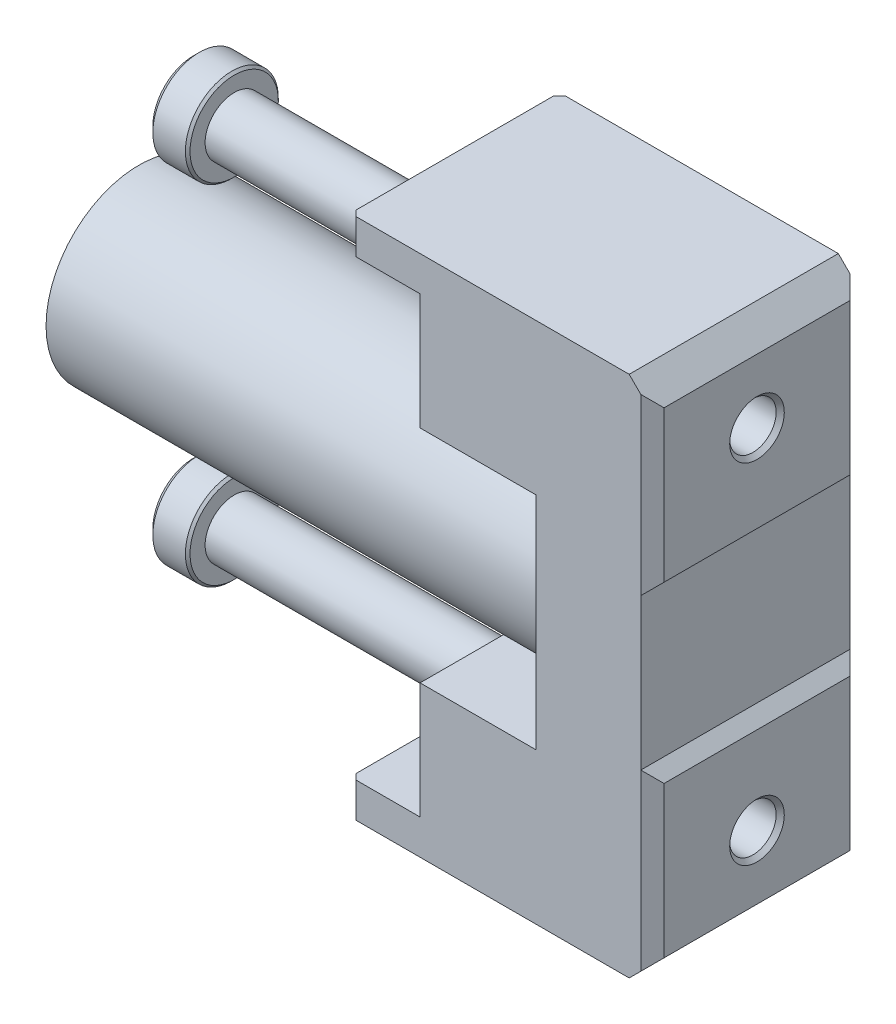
ISO-10303-21;
HEADER;
FILE_DESCRIPTION(('STEP AP214'),'2;1');
FILE_NAME('part.step','',(''),(''),'','','');
FILE_SCHEMA(('AUTOMOTIVE_DESIGN { 1 0 10303 214 1 1 1 1 }'));
ENDSEC;
DATA;
#1=APPLICATION_CONTEXT('core data for automotive mechanical design processes');
#2=APPLICATION_PROTOCOL_DEFINITION('international standard','automotive_design',2000,#1);
#3=PRODUCT_CONTEXT('',#1,'mechanical');
#4=PRODUCT('Part','Part','',(#3));
#5=PRODUCT_RELATED_PRODUCT_CATEGORY('part','',(#4));
#6=PRODUCT_DEFINITION_FORMATION('','',#4);
#7=PRODUCT_DEFINITION_CONTEXT('part definition',#1,'design');
#8=PRODUCT_DEFINITION('design','',#6,#7);
#9=PRODUCT_DEFINITION_SHAPE('','',#8);
#10=(LENGTH_UNIT() NAMED_UNIT(*) SI_UNIT(.MILLI.,.METRE.));
#11=(NAMED_UNIT(*) PLANE_ANGLE_UNIT() SI_UNIT($,.RADIAN.));
#12=(NAMED_UNIT(*) SI_UNIT($,.STERADIAN.) SOLID_ANGLE_UNIT());
#13=UNCERTAINTY_MEASURE_WITH_UNIT(LENGTH_MEASURE(1.E-05),#10,'distance_accuracy_value','');
#14=(GEOMETRIC_REPRESENTATION_CONTEXT(3) GLOBAL_UNCERTAINTY_ASSIGNED_CONTEXT((#13)) GLOBAL_UNIT_ASSIGNED_CONTEXT((#10,
#11,#12)) REPRESENTATION_CONTEXT('',''));
#15=CARTESIAN_POINT('',(0.,0.,0.));
#16=DIRECTION('',(0.,0.,1.));
#17=DIRECTION('',(1.,0.,0.));
#18=AXIS2_PLACEMENT_3D('',#15,#16,#17);
#19=CARTESIAN_POINT('',(-10.,-9.5,-3.36364838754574));
#20=DIRECTION('',(1.,0.,0.));
#21=DIRECTION('',(0.,0.,-1.));
#22=AXIS2_PLACEMENT_3D('',#19,#20,#21);
#23=PLANE('',#22);
#24=DIRECTION('',(0.,0.,-1.));
#25=VECTOR('',#24,1.);
#26=CARTESIAN_POINT('',(-10.,-9.5,-3.36364838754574));
#27=LINE('',#26,#25);
#28=CARTESIAN_POINT('',(-10.,-9.5,9.));
#29=VERTEX_POINT('',#28);
#30=CARTESIAN_POINT('',(-10.,-9.5,-9.));
#31=VERTEX_POINT('',#30);
#32=EDGE_CURVE('E420',#29,#31,#27,.T.);
#33=ORIENTED_EDGE('',*,*,#32,.F.);
#34=DIRECTION('',(0.,1.,0.));
#35=VECTOR('',#34,1.);
#36=CARTESIAN_POINT('',(-10.,9.5,9.));
#37=LINE('',#36,#35);
#38=CARTESIAN_POINT('',(-10.,9.5,9.));
#39=VERTEX_POINT('',#38);
#40=EDGE_CURVE('E265',#29,#39,#37,.T.);
#41=ORIENTED_EDGE('',*,*,#40,.T.);
#42=DIRECTION('',(0.,0.,-1.));
#43=VECTOR('',#42,1.);
#44=CARTESIAN_POINT('',(-10.,9.5,-3.36364838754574));
#45=LINE('',#44,#43);
#46=CARTESIAN_POINT('',(-10.,9.5,-9.));
#47=VERTEX_POINT('',#46);
#48=EDGE_CURVE('E431',#39,#47,#45,.T.);
#49=ORIENTED_EDGE('',*,*,#48,.T.);
#50=DIRECTION('',(0.,1.,0.));
#51=VECTOR('',#50,1.);
#52=CARTESIAN_POINT('',(-10.,-9.5,-9.));
#53=LINE('',#52,#51);
#54=EDGE_CURVE('E428',#31,#47,#53,.T.);
#55=ORIENTED_EDGE('',*,*,#54,.F.);
#56=EDGE_LOOP('',(#33,#41,#49,#55));
#57=FACE_BOUND('',#56,.T.);
#58=CARTESIAN_POINT('',(-10.,0.,0.));
#59=DIRECTION('',(1.,0.,0.));
#60=DIRECTION('',(0.,0.,-1.));
#61=AXIS2_PLACEMENT_3D('',#58,#59,#60);
#62=CIRCLE('',#61,8.);
#63=CARTESIAN_POINT('',(-10.,0.,-8.));
#64=VERTEX_POINT('',#63);
#65=EDGE_CURVE('E9',#64,#64,#62,.F.);
#66=ORIENTED_EDGE('',*,*,#65,.F.);
#67=EDGE_LOOP('',(#66));
#68=FACE_BOUND('',#67,.T.);
#69=ADVANCED_FACE('F14',(#57,#68),#23,.F.);
#70=CARTESIAN_POINT('',(-20.,-9.5,9.));
#71=DIRECTION('',(0.,-1.,0.));
#72=DIRECTION('',(1.,0.,0.));
#73=AXIS2_PLACEMENT_3D('',#70,#71,#72);
#74=PLANE('',#73);
#75=DIRECTION('',(1.,0.,0.));
#76=VECTOR('',#75,1.);
#77=CARTESIAN_POINT('',(-5.5,-9.5,9.));
#78=LINE('',#77,#76);
#79=CARTESIAN_POINT('',(-20.,-9.5,9.));
#80=VERTEX_POINT('',#79);
#81=EDGE_CURVE('E417',#80,#29,#78,.T.);
#82=ORIENTED_EDGE('',*,*,#81,.T.);
#83=ORIENTED_EDGE('',*,*,#32,.T.);
#84=DIRECTION('',(-1.,0.,0.));
#85=VECTOR('',#84,1.);
#86=CARTESIAN_POINT('',(-10.,-9.5,-9.));
#87=LINE('',#86,#85);
#88=CARTESIAN_POINT('',(-20.,-9.5,-9.));
#89=VERTEX_POINT('',#88);
#90=EDGE_CURVE('E424',#31,#89,#87,.T.);
#91=ORIENTED_EDGE('',*,*,#90,.T.);
#92=DIRECTION('',(0.,0.,1.));
#93=VECTOR('',#92,1.);
#94=CARTESIAN_POINT('',(-20.,-9.5,9.));
#95=LINE('',#94,#93);
#96=EDGE_CURVE('E426',#89,#80,#95,.T.);
#97=ORIENTED_EDGE('',*,*,#96,.T.);
#98=EDGE_LOOP('',(#82,#83,#91,#97));
#99=FACE_BOUND('',#98,.T.);
#100=ADVANCED_FACE('F649',(#99),#74,.F.);
#101=CARTESIAN_POINT('',(-20.,9.5,9.));
#102=DIRECTION('',(0.,-1.,0.));
#103=DIRECTION('',(1.,0.,0.));
#104=AXIS2_PLACEMENT_3D('',#101,#102,#103);
#105=PLANE('',#104);
#106=ORIENTED_EDGE('',*,*,#48,.F.);
#107=DIRECTION('',(1.,0.,0.));
#108=VECTOR('',#107,1.);
#109=CARTESIAN_POINT('',(-5.5,9.5,9.));
#110=LINE('',#109,#108);
#111=CARTESIAN_POINT('',(-20.,9.5,9.));
#112=VERTEX_POINT('',#111);
#113=EDGE_CURVE('E416',#112,#39,#110,.T.);
#114=ORIENTED_EDGE('',*,*,#113,.F.);
#115=DIRECTION('',(0.,0.,1.));
#116=VECTOR('',#115,1.);
#117=CARTESIAN_POINT('',(-20.,9.5,9.));
#118=LINE('',#117,#116);
#119=CARTESIAN_POINT('',(-20.,9.5,-9.));
#120=VERTEX_POINT('',#119);
#121=EDGE_CURVE('E421',#120,#112,#118,.T.);
#122=ORIENTED_EDGE('',*,*,#121,.F.);
#123=DIRECTION('',(-1.,0.,0.));
#124=VECTOR('',#123,1.);
#125=CARTESIAN_POINT('',(-10.,9.5,-9.));
#126=LINE('',#125,#124);
#127=EDGE_CURVE('E434',#47,#120,#126,.T.);
#128=ORIENTED_EDGE('',*,*,#127,.F.);
#129=EDGE_LOOP('',(#106,#114,#122,#128));
#130=FACE_BOUND('',#129,.T.);
#131=ADVANCED_FACE('F645',(#130),#105,.T.);
#132=CARTESIAN_POINT('',(-20.,-19.5,9.));
#133=DIRECTION('',(1.,0.,0.));
#134=DIRECTION('',(0.,1.,0.));
#135=AXIS2_PLACEMENT_3D('',#132,#133,#134);
#136=PLANE('',#135);
#137=CARTESIAN_POINT('',(-20.,15.,0.));
#138=DIRECTION('',(1.,0.,0.));
#139=DIRECTION('',(0.,1.,0.));
#140=AXIS2_PLACEMENT_3D('',#137,#138,#139);
#141=CIRCLE('',#140,2.5);
#142=CARTESIAN_POINT('',(-20.,17.5,0.));
#143=VERTEX_POINT('',#142);
#144=EDGE_CURVE('E23',#143,#143,#141,.F.);
#145=ORIENTED_EDGE('',*,*,#144,.F.);
#146=EDGE_LOOP('',(#145));
#147=FACE_BOUND('',#146,.T.);
#148=ORIENTED_EDGE('',*,*,#121,.T.);
#149=DIRECTION('',(0.,-1.,0.));
#150=VECTOR('',#149,1.);
#151=CARTESIAN_POINT('',(-20.,-19.5,9.));
#152=LINE('',#151,#150);
#153=CARTESIAN_POINT('',(-20.,19.5,9.));
#154=VERTEX_POINT('',#153);
#155=EDGE_CURVE('E470',#154,#112,#152,.T.);
#156=ORIENTED_EDGE('',*,*,#155,.F.);
#157=DIRECTION('',(0.,0.,-1.));
#158=VECTOR('',#157,1.);
#159=CARTESIAN_POINT('',(-20.,19.5,9.));
#160=LINE('',#159,#158);
#161=CARTESIAN_POINT('',(-20.,19.5,-9.));
#162=VERTEX_POINT('',#161);
#163=EDGE_CURVE('E498',#154,#162,#160,.T.);
#164=ORIENTED_EDGE('',*,*,#163,.T.);
#165=DIRECTION('',(0.,-1.,0.));
#166=VECTOR('',#165,1.);
#167=CARTESIAN_POINT('',(-20.,-19.5,-9.));
#168=LINE('',#167,#166);
#169=EDGE_CURVE('E482',#162,#120,#168,.T.);
#170=ORIENTED_EDGE('',*,*,#169,.T.);
#171=EDGE_LOOP('',(#148,#156,#164,#170));
#172=FACE_BOUND('',#171,.T.);
#173=ADVANCED_FACE('F642',(#147,#172),#136,.F.);
#174=CARTESIAN_POINT('',(0.,22.5,9.));
#175=DIRECTION('',(-1.,0.,0.));
#176=DIRECTION('',(0.,-1.,0.));
#177=AXIS2_PLACEMENT_3D('',#174,#175,#176);
#178=PLANE('',#177);
#179=CARTESIAN_POINT('',(0.,-15.,0.));
#180=DIRECTION('',(1.,0.,0.));
#181=DIRECTION('',(0.,1.,0.));
#182=AXIS2_PLACEMENT_3D('',#179,#180,#181);
#183=CIRCLE('',#182,2.35);
#184=CARTESIAN_POINT('',(0.,-12.65,0.));
#185=VERTEX_POINT('',#184);
#186=EDGE_CURVE('E444',#185,#185,#183,.T.);
#187=ORIENTED_EDGE('',*,*,#186,.F.);
#188=EDGE_LOOP('',(#187));
#189=FACE_BOUND('',#188,.T.);
#190=DIRECTION('',(0.,0.,-1.));
#191=VECTOR('',#190,1.);
#192=CARTESIAN_POINT('',(0.,-20.5,9.));
#193=LINE('',#192,#191);
#194=CARTESIAN_POINT('',(0.,-20.5,8.));
#195=VERTEX_POINT('',#194);
#196=CARTESIAN_POINT('',(0.,-20.5,-8.));
#197=VERTEX_POINT('',#196);
#198=EDGE_CURVE('E233',#195,#197,#193,.T.);
#199=ORIENTED_EDGE('',*,*,#198,.T.);
#200=DIRECTION('',(0.,1.,0.));
#201=VECTOR('',#200,1.);
#202=CARTESIAN_POINT('',(0.,-7.5,-8.));
#203=LINE('',#202,#201);
#204=CARTESIAN_POINT('',(0.,-7.5,-8.));
#205=VERTEX_POINT('',#204);
#206=EDGE_CURVE('E577',#197,#205,#203,.T.);
#207=ORIENTED_EDGE('',*,*,#206,.T.);
#208=DIRECTION('',(0.,0.,1.));
#209=VECTOR('',#208,1.);
#210=CARTESIAN_POINT('',(0.,-7.5,-9.));
#211=LINE('',#210,#209);
#212=CARTESIAN_POINT('',(0.,-7.5,8.));
#213=VERTEX_POINT('',#212);
#214=EDGE_CURVE('E454',#205,#213,#211,.T.);
#215=ORIENTED_EDGE('',*,*,#214,.T.);
#216=DIRECTION('',(0.,-1.,0.));
#217=VECTOR('',#216,1.);
#218=CARTESIAN_POINT('',(0.,22.5,8.));
#219=LINE('',#218,#217);
#220=EDGE_CURVE('E575',#213,#195,#219,.T.);
#221=ORIENTED_EDGE('',*,*,#220,.T.);
#222=EDGE_LOOP('',(#199,#207,#215,#221));
#223=FACE_BOUND('',#222,.T.);
#224=ADVANCED_FACE('F586',(#189,#223),#178,.F.);
#225=CARTESIAN_POINT('',(0.,15.,0.));
#226=DIRECTION('',(1.,0.,0.));
#227=DIRECTION('',(0.,1.,0.));
#228=AXIS2_PLACEMENT_3D('',#225,#226,#227);
#229=CIRCLE('',#228,2.35);
#230=CARTESIAN_POINT('',(0.,17.35,0.));
#231=VERTEX_POINT('',#230);
#232=EDGE_CURVE('E441',#231,#231,#229,.T.);
#233=ORIENTED_EDGE('',*,*,#232,.F.);
#234=EDGE_LOOP('',(#233));
#235=FACE_BOUND('',#234,.T.);
#236=DIRECTION('',(0.,0.,1.));
#237=VECTOR('',#236,1.);
#238=CARTESIAN_POINT('',(0.,7.5,-9.));
#239=LINE('',#238,#237);
#240=CARTESIAN_POINT('',(0.,7.5,-8.));
#241=VERTEX_POINT('',#240);
#242=CARTESIAN_POINT('',(0.,7.5,8.));
#243=VERTEX_POINT('',#242);
#244=EDGE_CURVE('E451',#241,#243,#239,.T.);
#245=ORIENTED_EDGE('',*,*,#244,.F.);
#246=DIRECTION('',(0.,1.,0.));
#247=VECTOR('',#246,1.);
#248=CARTESIAN_POINT('',(0.,20.5,-8.));
#249=LINE('',#248,#247);
#250=CARTESIAN_POINT('',(0.,20.5,-8.));
#251=VERTEX_POINT('',#250);
#252=EDGE_CURVE('E560',#241,#251,#249,.T.);
#253=ORIENTED_EDGE('',*,*,#252,.T.);
#254=DIRECTION('',(0.,0.,1.));
#255=VECTOR('',#254,1.);
#256=CARTESIAN_POINT('',(0.,20.5,9.));
#257=LINE('',#256,#255);
#258=CARTESIAN_POINT('',(0.,20.5,8.));
#259=VERTEX_POINT('',#258);
#260=EDGE_CURVE('E555',#251,#259,#257,.T.);
#261=ORIENTED_EDGE('',*,*,#260,.T.);
#262=DIRECTION('',(0.,-1.,0.));
#263=VECTOR('',#262,1.);
#264=CARTESIAN_POINT('',(0.,22.5,8.));
#265=LINE('',#264,#263);
#266=EDGE_CURVE('E558',#259,#243,#265,.T.);
#267=ORIENTED_EDGE('',*,*,#266,.T.);
#268=EDGE_LOOP('',(#245,#253,#261,#267));
#269=FACE_BOUND('',#268,.T.);
#270=ADVANCED_FACE('F608',(#235,#269),#178,.F.);
#271=CARTESIAN_POINT('',(0.,22.5,9.));
#272=DIRECTION('',(0.,-1.,0.));
#273=DIRECTION('',(1.,0.,0.));
#274=AXIS2_PLACEMENT_3D('',#271,#272,#273);
#275=PLANE('',#274);
#276=DIRECTION('',(-1.,0.,0.));
#277=VECTOR('',#276,1.);
#278=CARTESIAN_POINT('',(0.,22.5,9.));
#279=LINE('',#278,#277);
#280=CARTESIAN_POINT('',(-2.,22.5,9.));
#281=VERTEX_POINT('',#280);
#282=CARTESIAN_POINT('',(-25.5,22.5,9.));
#283=VERTEX_POINT('',#282);
#284=EDGE_CURVE('E464',#281,#283,#279,.T.);
#285=ORIENTED_EDGE('',*,*,#284,.F.);
#286=DIRECTION('',(0.,0.,-1.));
#287=VECTOR('',#286,1.);
#288=CARTESIAN_POINT('',(-2.,22.5,9.));
#289=LINE('',#288,#287);
#290=CARTESIAN_POINT('',(-2.,22.5,-9.));
#291=VERTEX_POINT('',#290);
#292=EDGE_CURVE('E250',#281,#291,#289,.T.);
#293=ORIENTED_EDGE('',*,*,#292,.T.);
#294=DIRECTION('',(-1.,0.,0.));
#295=VECTOR('',#294,1.);
#296=CARTESIAN_POINT('',(0.,22.5,-9.));
#297=LINE('',#296,#295);
#298=CARTESIAN_POINT('',(-25.5,22.5,-9.));
#299=VERTEX_POINT('',#298);
#300=EDGE_CURVE('E456',#291,#299,#297,.T.);
#301=ORIENTED_EDGE('',*,*,#300,.T.);
#302=DIRECTION('',(-0.707106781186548,0.,0.707106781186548));
#303=VECTOR('',#302,1.);
#304=CARTESIAN_POINT('',(-26.,22.5,-8.5));
#305=LINE('',#304,#303);
#306=CARTESIAN_POINT('',(-26.,22.5,-8.5));
#307=VERTEX_POINT('',#306);
#308=EDGE_CURVE('E542',#299,#307,#305,.T.);
#309=ORIENTED_EDGE('',*,*,#308,.T.);
#310=DIRECTION('',(0.,0.,-1.));
#311=VECTOR('',#310,1.);
#312=CARTESIAN_POINT('',(-26.,22.5,9.));
#313=LINE('',#312,#311);
#314=CARTESIAN_POINT('',(-26.,22.5,8.5));
#315=VERTEX_POINT('',#314);
#316=EDGE_CURVE('E504',#315,#307,#313,.T.);
#317=ORIENTED_EDGE('',*,*,#316,.F.);
#318=DIRECTION('',(-0.707106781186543,0.,-0.707106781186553));
#319=VECTOR('',#318,1.);
#320=CARTESIAN_POINT('',(-25.5,22.5,9.));
#321=LINE('',#320,#319);
#322=EDGE_CURVE('E539',#315,#283,#321,.F.);
#323=ORIENTED_EDGE('',*,*,#322,.T.);
#324=EDGE_LOOP('',(#285,#293,#301,#309,#317,#323));
#325=FACE_BOUND('',#324,.T.);
#326=ADVANCED_FACE('F619',(#325),#275,.F.);
#327=CARTESIAN_POINT('',(-26.,22.5,9.));
#328=DIRECTION('',(1.,0.,0.));
#329=DIRECTION('',(0.,1.,0.));
#330=AXIS2_PLACEMENT_3D('',#327,#328,#329);
#331=PLANE('',#330);
#332=ORIENTED_EDGE('',*,*,#316,.T.);
#333=DIRECTION('',(0.,-1.,0.));
#334=VECTOR('',#333,1.);
#335=CARTESIAN_POINT('',(-26.,19.5,-8.5));
#336=LINE('',#335,#334);
#337=CARTESIAN_POINT('',(-26.,19.5,-8.5));
#338=VERTEX_POINT('',#337);
#339=EDGE_CURVE('E532',#307,#338,#336,.T.);
#340=ORIENTED_EDGE('',*,*,#339,.T.);
#341=DIRECTION('',(0.,0.,-1.));
#342=VECTOR('',#341,1.);
#343=CARTESIAN_POINT('',(-26.,19.5,9.));
#344=LINE('',#343,#342);
#345=CARTESIAN_POINT('',(-26.,19.5,8.5));
#346=VERTEX_POINT('',#345);
#347=EDGE_CURVE('E501',#346,#338,#344,.T.);
#348=ORIENTED_EDGE('',*,*,#347,.F.);
#349=DIRECTION('',(0.,1.,0.));
#350=VECTOR('',#349,1.);
#351=CARTESIAN_POINT('',(-26.,22.5,8.5));
#352=LINE('',#351,#350);
#353=EDGE_CURVE('E530',#346,#315,#352,.T.);
#354=ORIENTED_EDGE('',*,*,#353,.T.);
#355=EDGE_LOOP('',(#332,#340,#348,#354));
#356=FACE_BOUND('',#355,.T.);
#357=ADVANCED_FACE('F630',(#356),#331,.F.);
#358=CARTESIAN_POINT('',(-20.,19.5,9.));
#359=DIRECTION('',(0.,1.,0.));
#360=DIRECTION('',(-1.,0.,0.));
#361=AXIS2_PLACEMENT_3D('',#358,#359,#360);
#362=PLANE('',#361);
#363=ORIENTED_EDGE('',*,*,#347,.T.);
#364=DIRECTION('',(0.707106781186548,0.,-0.707106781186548));
#365=VECTOR('',#364,1.);
#366=CARTESIAN_POINT('',(-26.,19.5,-8.5));
#367=LINE('',#366,#365);
#368=CARTESIAN_POINT('',(-25.5,19.5,-9.));
#369=VERTEX_POINT('',#368);
#370=EDGE_CURVE('E537',#338,#369,#367,.T.);
#371=ORIENTED_EDGE('',*,*,#370,.T.);
#372=DIRECTION('',(1.,0.,0.));
#373=VECTOR('',#372,1.);
#374=CARTESIAN_POINT('',(-20.,19.5,-9.));
#375=LINE('',#374,#373);
#376=EDGE_CURVE('E479',#369,#162,#375,.T.);
#377=ORIENTED_EDGE('',*,*,#376,.T.);
#378=ORIENTED_EDGE('',*,*,#163,.F.);
#379=DIRECTION('',(1.,0.,0.));
#380=VECTOR('',#379,1.);
#381=CARTESIAN_POINT('',(-20.,19.5,9.));
#382=LINE('',#381,#380);
#383=CARTESIAN_POINT('',(-25.5,19.5,9.));
#384=VERTEX_POINT('',#383);
#385=EDGE_CURVE('E466',#384,#154,#382,.T.);
#386=ORIENTED_EDGE('',*,*,#385,.F.);
#387=DIRECTION('',(0.707106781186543,0.,0.707106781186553));
#388=VECTOR('',#387,1.);
#389=CARTESIAN_POINT('',(-25.5,19.5,9.));
#390=LINE('',#389,#388);
#391=EDGE_CURVE('E535',#384,#346,#390,.F.);
#392=ORIENTED_EDGE('',*,*,#391,.T.);
#393=EDGE_LOOP('',(#363,#371,#377,#378,#386,#392));
#394=FACE_BOUND('',#393,.T.);
#395=ADVANCED_FACE('F639',(#394),#362,.F.);
#396=CARTESIAN_POINT('',(-20.,-15.,0.));
#397=DIRECTION('',(1.,0.,0.));
#398=DIRECTION('',(0.,1.,0.));
#399=AXIS2_PLACEMENT_3D('',#396,#397,#398);
#400=CIRCLE('',#399,2.5);
#401=CARTESIAN_POINT('',(-20.,-12.5,0.));
#402=VERTEX_POINT('',#401);
#403=EDGE_CURVE('E306',#402,#402,#400,.F.);
#404=ORIENTED_EDGE('',*,*,#403,.F.);
#405=EDGE_LOOP('',(#404));
#406=FACE_BOUND('',#405,.T.);
#407=CARTESIAN_POINT('',(-20.,-19.5,9.));
#408=VERTEX_POINT('',#407);
#409=EDGE_CURVE('E469',#80,#408,#152,.T.);
#410=ORIENTED_EDGE('',*,*,#409,.F.);
#411=ORIENTED_EDGE('',*,*,#96,.F.);
#412=CARTESIAN_POINT('',(-20.,-19.5,-9.));
#413=VERTEX_POINT('',#412);
#414=EDGE_CURVE('E481',#89,#413,#168,.T.);
#415=ORIENTED_EDGE('',*,*,#414,.T.);
#416=DIRECTION('',(0.,0.,-1.));
#417=VECTOR('',#416,1.);
#418=CARTESIAN_POINT('',(-20.,-19.5,9.));
#419=LINE('',#418,#417);
#420=EDGE_CURVE('E495',#408,#413,#419,.T.);
#421=ORIENTED_EDGE('',*,*,#420,.F.);
#422=EDGE_LOOP('',(#410,#411,#415,#421));
#423=FACE_BOUND('',#422,.T.);
#424=ADVANCED_FACE('F656',(#406,#423),#136,.F.);
#425=CARTESIAN_POINT('',(-26.,-19.5,9.));
#426=DIRECTION('',(0.,-1.,0.));
#427=DIRECTION('',(1.,0.,0.));
#428=AXIS2_PLACEMENT_3D('',#425,#426,#427);
#429=PLANE('',#428);
#430=DIRECTION('',(0.,0.,-1.));
#431=VECTOR('',#430,1.);
#432=CARTESIAN_POINT('',(-26.,-19.5,9.));
#433=LINE('',#432,#431);
#434=CARTESIAN_POINT('',(-26.,-19.5,8.5));
#435=VERTEX_POINT('',#434);
#436=CARTESIAN_POINT('',(-26.,-19.5,-8.5));
#437=VERTEX_POINT('',#436);
#438=EDGE_CURVE('E492',#435,#437,#433,.T.);
#439=ORIENTED_EDGE('',*,*,#438,.F.);
#440=DIRECTION('',(-0.707106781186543,0.,-0.707106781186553));
#441=VECTOR('',#440,1.);
#442=CARTESIAN_POINT('',(-25.5,-19.5,9.));
#443=LINE('',#442,#441);
#444=CARTESIAN_POINT('',(-25.5,-19.5,9.));
#445=VERTEX_POINT('',#444);
#446=EDGE_CURVE('E523',#435,#445,#443,.F.);
#447=ORIENTED_EDGE('',*,*,#446,.T.);
#448=DIRECTION('',(-1.,0.,0.));
#449=VECTOR('',#448,1.);
#450=CARTESIAN_POINT('',(-26.,-19.5,9.));
#451=LINE('',#450,#449);
#452=EDGE_CURVE('E473',#408,#445,#451,.T.);
#453=ORIENTED_EDGE('',*,*,#452,.F.);
#454=ORIENTED_EDGE('',*,*,#420,.T.);
#455=DIRECTION('',(-1.,0.,0.));
#456=VECTOR('',#455,1.);
#457=CARTESIAN_POINT('',(-26.,-19.5,-9.));
#458=LINE('',#457,#456);
#459=CARTESIAN_POINT('',(-25.5,-19.5,-9.));
#460=VERTEX_POINT('',#459);
#461=EDGE_CURVE('E485',#413,#460,#458,.T.);
#462=ORIENTED_EDGE('',*,*,#461,.T.);
#463=DIRECTION('',(-0.707106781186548,0.,0.707106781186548));
#464=VECTOR('',#463,1.);
#465=CARTESIAN_POINT('',(-26.,-19.5,-8.5));
#466=LINE('',#465,#464);
#467=EDGE_CURVE('E521',#460,#437,#466,.T.);
#468=ORIENTED_EDGE('',*,*,#467,.T.);
#469=EDGE_LOOP('',(#439,#447,#453,#454,#462,#468));
#470=FACE_BOUND('',#469,.T.);
#471=ADVANCED_FACE('F660',(#470),#429,.F.);
#472=CARTESIAN_POINT('',(-26.,-19.5,9.));
#473=DIRECTION('',(1.,0.,0.));
#474=DIRECTION('',(0.,1.,0.));
#475=AXIS2_PLACEMENT_3D('',#472,#473,#474);
#476=PLANE('',#475);
#477=DIRECTION('',(0.,0.,-1.));
#478=VECTOR('',#477,1.);
#479=CARTESIAN_POINT('',(-26.,-22.5,9.));
#480=LINE('',#479,#478);
#481=CARTESIAN_POINT('',(-26.,-22.5,8.5));
#482=VERTEX_POINT('',#481);
#483=CARTESIAN_POINT('',(-26.,-22.5,-8.5));
#484=VERTEX_POINT('',#483);
#485=EDGE_CURVE('E477',#482,#484,#480,.T.);
#486=ORIENTED_EDGE('',*,*,#485,.F.);
#487=DIRECTION('',(0.,1.,0.));
#488=VECTOR('',#487,1.);
#489=CARTESIAN_POINT('',(-26.,-19.5,8.5));
#490=LINE('',#489,#488);
#491=EDGE_CURVE('E519',#482,#435,#490,.T.);
#492=ORIENTED_EDGE('',*,*,#491,.T.);
#493=ORIENTED_EDGE('',*,*,#438,.T.);
#494=DIRECTION('',(0.,-1.,0.));
#495=VECTOR('',#494,1.);
#496=CARTESIAN_POINT('',(-26.,-22.5,-8.5));
#497=LINE('',#496,#495);
#498=EDGE_CURVE('E516',#437,#484,#497,.T.);
#499=ORIENTED_EDGE('',*,*,#498,.T.);
#500=EDGE_LOOP('',(#486,#492,#493,#499));
#501=FACE_BOUND('',#500,.T.);
#502=ADVANCED_FACE('F671',(#501),#476,.F.);
#503=CARTESIAN_POINT('',(0.,-22.5,9.));
#504=DIRECTION('',(0.,1.,0.));
#505=DIRECTION('',(-1.,0.,0.));
#506=AXIS2_PLACEMENT_3D('',#503,#504,#505);
#507=PLANE('',#506);
#508=DIRECTION('',(1.,0.,0.));
#509=VECTOR('',#508,1.);
#510=CARTESIAN_POINT('',(0.,-22.5,-9.));
#511=LINE('',#510,#509);
#512=CARTESIAN_POINT('',(-25.5,-22.5,-9.));
#513=VERTEX_POINT('',#512);
#514=CARTESIAN_POINT('',(-2.,-22.5,-9.));
#515=VERTEX_POINT('',#514);
#516=EDGE_CURVE('E467',#513,#515,#511,.T.);
#517=ORIENTED_EDGE('',*,*,#516,.T.);
#518=DIRECTION('',(0.,0.,1.));
#519=VECTOR('',#518,1.);
#520=CARTESIAN_POINT('',(-2.,-22.5,9.));
#521=LINE('',#520,#519);
#522=CARTESIAN_POINT('',(-2.,-22.5,9.));
#523=VERTEX_POINT('',#522);
#524=EDGE_CURVE('E550',#515,#523,#521,.T.);
#525=ORIENTED_EDGE('',*,*,#524,.T.);
#526=DIRECTION('',(1.,0.,0.));
#527=VECTOR('',#526,1.);
#528=CARTESIAN_POINT('',(0.,-22.5,9.));
#529=LINE('',#528,#527);
#530=CARTESIAN_POINT('',(-25.5,-22.5,9.));
#531=VERTEX_POINT('',#530);
#532=EDGE_CURVE('E249',#531,#523,#529,.T.);
#533=ORIENTED_EDGE('',*,*,#532,.F.);
#534=DIRECTION('',(0.707106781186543,0.,0.707106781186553));
#535=VECTOR('',#534,1.);
#536=CARTESIAN_POINT('',(-25.5,-22.5,9.));
#537=LINE('',#536,#535);
#538=EDGE_CURVE('E514',#531,#482,#537,.F.);
#539=ORIENTED_EDGE('',*,*,#538,.T.);
#540=ORIENTED_EDGE('',*,*,#485,.T.);
#541=DIRECTION('',(0.707106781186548,0.,-0.707106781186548));
#542=VECTOR('',#541,1.);
#543=CARTESIAN_POINT('',(-26.,-22.5,-8.5));
#544=LINE('',#543,#542);
#545=EDGE_CURVE('E512',#484,#513,#544,.T.);
#546=ORIENTED_EDGE('',*,*,#545,.T.);
#547=EDGE_LOOP('',(#517,#525,#533,#539,#540,#546));
#548=FACE_BOUND('',#547,.T.);
#549=ADVANCED_FACE('F669',(#548),#507,.F.);
#550=CARTESIAN_POINT('',(0.,-22.5,9.));
#551=DIRECTION('',(0.,0.,-1.));
#552=DIRECTION('',(0.,-1.,0.));
#553=AXIS2_PLACEMENT_3D('',#550,#551,#552);
#554=PLANE('',#553);
#555=ORIENTED_EDGE('',*,*,#40,.F.);
#556=ORIENTED_EDGE('',*,*,#81,.F.);
#557=ORIENTED_EDGE('',*,*,#409,.T.);
#558=ORIENTED_EDGE('',*,*,#452,.T.);
#559=DIRECTION('',(0.,-1.,0.));
#560=VECTOR('',#559,1.);
#561=CARTESIAN_POINT('',(-25.5,-22.5,9.));
#562=LINE('',#561,#560);
#563=EDGE_CURVE('E510',#445,#531,#562,.T.);
#564=ORIENTED_EDGE('',*,*,#563,.T.);
#565=ORIENTED_EDGE('',*,*,#532,.T.);
#566=DIRECTION('',(-0.70710678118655,-0.707106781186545,0.));
#567=VECTOR('',#566,1.);
#568=CARTESIAN_POINT('',(0.,-20.5,9.));
#569=LINE('',#568,#567);
#570=CARTESIAN_POINT('',(-1.,-21.5,9.));
#571=VERTEX_POINT('',#570);
#572=EDGE_CURVE('E231',#523,#571,#569,.F.);
#573=ORIENTED_EDGE('',*,*,#572,.T.);
#574=DIRECTION('',(0.,1.,0.));
#575=VECTOR('',#574,1.);
#576=CARTESIAN_POINT('',(-1.,-22.5,9.));
#577=LINE('',#576,#575);
#578=CARTESIAN_POINT('',(-1.,-6.5,9.));
#579=VERTEX_POINT('',#578);
#580=EDGE_CURVE('E246',#571,#579,#577,.T.);
#581=ORIENTED_EDGE('',*,*,#580,.T.);
#582=DIRECTION('',(0.,-1.,0.));
#583=VECTOR('',#582,1.);
#584=CARTESIAN_POINT('',(-1.,6.5,9.));
#585=LINE('',#584,#583);
#586=CARTESIAN_POINT('',(-1.,6.5,9.));
#587=VERTEX_POINT('',#586);
#588=EDGE_CURVE('E447',#587,#579,#585,.T.);
#589=ORIENTED_EDGE('',*,*,#588,.F.);
#590=DIRECTION('',(0.,1.,0.));
#591=VECTOR('',#590,1.);
#592=CARTESIAN_POINT('',(-1.,-22.5,9.));
#593=LINE('',#592,#591);
#594=CARTESIAN_POINT('',(-1.,21.5,9.));
#595=VERTEX_POINT('',#594);
#596=EDGE_CURVE('E255',#587,#595,#593,.T.);
#597=ORIENTED_EDGE('',*,*,#596,.T.);
#598=DIRECTION('',(0.707106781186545,-0.70710678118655,0.));
#599=VECTOR('',#598,1.);
#600=CARTESIAN_POINT('',(-2.,22.5,9.));
#601=LINE('',#600,#599);
#602=EDGE_CURVE('E251',#595,#281,#601,.F.);
#603=ORIENTED_EDGE('',*,*,#602,.T.);
#604=ORIENTED_EDGE('',*,*,#284,.T.);
#605=DIRECTION('',(0.,-1.,0.));
#606=VECTOR('',#605,1.);
#607=CARTESIAN_POINT('',(-25.5,-22.5,9.));
#608=LINE('',#607,#606);
#609=EDGE_CURVE('E507',#283,#384,#608,.T.);
#610=ORIENTED_EDGE('',*,*,#609,.T.);
#611=ORIENTED_EDGE('',*,*,#385,.T.);
#612=ORIENTED_EDGE('',*,*,#155,.T.);
#613=ORIENTED_EDGE('',*,*,#113,.T.);
#614=EDGE_LOOP('',(#555,#556,#557,#558,#564,#565,#573,#581,#589,#597,#603,#604,#610,#611,#612,#613));
#615=FACE_BOUND('',#614,.T.);
#616=ADVANCED_FACE('F244',(#615),#554,.F.);
#617=CARTESIAN_POINT('',(0.,-22.5,-9.));
#618=DIRECTION('',(0.,0.,-1.));
#619=DIRECTION('',(0.,-1.,0.));
#620=AXIS2_PLACEMENT_3D('',#617,#618,#619);
#621=PLANE('',#620);
#622=ORIENTED_EDGE('',*,*,#90,.F.);
#623=ORIENTED_EDGE('',*,*,#54,.T.);
#624=ORIENTED_EDGE('',*,*,#127,.T.);
#625=ORIENTED_EDGE('',*,*,#169,.F.);
#626=ORIENTED_EDGE('',*,*,#376,.F.);
#627=DIRECTION('',(0.,1.,0.));
#628=VECTOR('',#627,1.);
#629=CARTESIAN_POINT('',(-25.5,22.5,-9.));
#630=LINE('',#629,#628);
#631=EDGE_CURVE('E525',#369,#299,#630,.T.);
#632=ORIENTED_EDGE('',*,*,#631,.T.);
#633=ORIENTED_EDGE('',*,*,#300,.F.);
#634=DIRECTION('',(-0.707106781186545,0.70710678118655,0.));
#635=VECTOR('',#634,1.);
#636=CARTESIAN_POINT('',(21.5,-1.00000000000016,-9.));
#637=LINE('',#636,#635);
#638=CARTESIAN_POINT('',(-1.,21.5,-9.));
#639=VERTEX_POINT('',#638);
#640=EDGE_CURVE('E545',#291,#639,#637,.F.);
#641=ORIENTED_EDGE('',*,*,#640,.T.);
#642=DIRECTION('',(0.,-1.,0.));
#643=VECTOR('',#642,1.);
#644=CARTESIAN_POINT('',(-1.,7.5,-9.));
#645=LINE('',#644,#643);
#646=CARTESIAN_POINT('',(-1.,6.5,-9.));
#647=VERTEX_POINT('',#646);
#648=EDGE_CURVE('E569',#639,#647,#645,.T.);
#649=ORIENTED_EDGE('',*,*,#648,.T.);
#650=DIRECTION('',(0.,-1.,0.));
#651=VECTOR('',#650,1.);
#652=CARTESIAN_POINT('',(-1.,6.5,-9.));
#653=LINE('',#652,#651);
#654=CARTESIAN_POINT('',(-1.,-6.5,-9.));
#655=VERTEX_POINT('',#654);
#656=EDGE_CURVE('E448',#647,#655,#653,.T.);
#657=ORIENTED_EDGE('',*,*,#656,.T.);
#658=DIRECTION('',(0.,-1.,0.));
#659=VECTOR('',#658,1.);
#660=CARTESIAN_POINT('',(-1.,-20.5,-9.));
#661=LINE('',#660,#659);
#662=CARTESIAN_POINT('',(-1.,-21.5,-9.));
#663=VERTEX_POINT('',#662);
#664=EDGE_CURVE('E567',#655,#663,#661,.T.);
#665=ORIENTED_EDGE('',*,*,#664,.T.);
#666=DIRECTION('',(0.70710678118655,0.707106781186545,0.));
#667=VECTOR('',#666,1.);
#668=CARTESIAN_POINT('',(-1.,-21.5,-9.));
#669=LINE('',#668,#667);
#670=EDGE_CURVE('E548',#663,#515,#669,.F.);
#671=ORIENTED_EDGE('',*,*,#670,.T.);
#672=ORIENTED_EDGE('',*,*,#516,.F.);
#673=DIRECTION('',(0.,1.,0.));
#674=VECTOR('',#673,1.);
#675=CARTESIAN_POINT('',(-25.5,-19.5,-9.));
#676=LINE('',#675,#674);
#677=EDGE_CURVE('E528',#513,#460,#676,.T.);
#678=ORIENTED_EDGE('',*,*,#677,.T.);
#679=ORIENTED_EDGE('',*,*,#461,.F.);
#680=ORIENTED_EDGE('',*,*,#414,.F.);
#681=EDGE_LOOP('',(#622,#623,#624,#625,#626,#632,#633,#641,#649,#657,#665,#671,#672,#678,#679,#680));
#682=FACE_BOUND('',#681,.T.);
#683=ADVANCED_FACE('F596',(#682),#621,.T.);
#684=CARTESIAN_POINT('',(0.,-7.5,-9.));
#685=DIRECTION('',(-0.707106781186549,-0.707106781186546,0.));
#686=DIRECTION('',(0.707106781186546,-0.707106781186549,0.));
#687=AXIS2_PLACEMENT_3D('',#684,#685,#686);
#688=PLANE('',#687);
#689=ORIENTED_EDGE('',*,*,#214,.F.);
#690=DIRECTION('',(-0.577350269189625,0.577350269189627,-0.577350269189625));
#691=VECTOR('',#690,1.);
#692=CARTESIAN_POINT('',(-10.,2.50000000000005,-18.));
#693=LINE('',#692,#691);
#694=EDGE_CURVE('E238',#205,#655,#693,.T.);
#695=ORIENTED_EDGE('',*,*,#694,.T.);
#696=DIRECTION('',(0.,0.,1.));
#697=VECTOR('',#696,1.);
#698=CARTESIAN_POINT('',(-1.,-6.5,-9.));
#699=LINE('',#698,#697);
#700=EDGE_CURVE('E457',#655,#579,#699,.T.);
#701=ORIENTED_EDGE('',*,*,#700,.T.);
#702=DIRECTION('',(-0.577350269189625,0.577350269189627,0.577350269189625));
#703=VECTOR('',#702,1.);
#704=CARTESIAN_POINT('',(4.33333333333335,-11.8333333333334,3.66666666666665));
#705=LINE('',#704,#703);
#706=EDGE_CURVE('E219',#579,#213,#705,.F.);
#707=ORIENTED_EDGE('',*,*,#706,.T.);
#708=EDGE_LOOP('',(#689,#695,#701,#707));
#709=FACE_BOUND('',#708,.T.);
#710=ADVANCED_FACE('F589',(#709),#688,.F.);
#711=CARTESIAN_POINT('',(-1.,6.5,-9.));
#712=DIRECTION('',(-1.,0.,0.));
#713=DIRECTION('',(0.,-1.,0.));
#714=AXIS2_PLACEMENT_3D('',#711,#712,#713);
#715=PLANE('',#714);
#716=ORIENTED_EDGE('',*,*,#588,.T.);
#717=ORIENTED_EDGE('',*,*,#700,.F.);
#718=ORIENTED_EDGE('',*,*,#656,.F.);
#719=DIRECTION('',(0.,0.,1.));
#720=VECTOR('',#719,1.);
#721=CARTESIAN_POINT('',(-1.,6.5,-9.));
#722=LINE('',#721,#720);
#723=EDGE_CURVE('E459',#647,#587,#722,.T.);
#724=ORIENTED_EDGE('',*,*,#723,.T.);
#725=EDGE_LOOP('',(#716,#717,#718,#724));
#726=FACE_BOUND('',#725,.T.);
#727=ADVANCED_FACE('F592',(#726),#715,.F.);
#728=CARTESIAN_POINT('',(0.,7.5,-9.));
#729=DIRECTION('',(-0.707106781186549,0.707106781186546,0.));
#730=DIRECTION('',(-0.707106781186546,-0.707106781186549,0.));
#731=AXIS2_PLACEMENT_3D('',#728,#729,#730);
#732=PLANE('',#731);
#733=ORIENTED_EDGE('',*,*,#723,.F.);
#734=DIRECTION('',(0.577350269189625,0.577350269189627,0.577350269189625));
#735=VECTOR('',#734,1.);
#736=CARTESIAN_POINT('',(5.,12.5,-3.));
#737=LINE('',#736,#735);
#738=EDGE_CURVE('E573',#647,#241,#737,.T.);
#739=ORIENTED_EDGE('',*,*,#738,.T.);
#740=ORIENTED_EDGE('',*,*,#244,.T.);
#741=DIRECTION('',(0.577350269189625,0.577350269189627,-0.577350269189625));
#742=VECTOR('',#741,1.);
#743=CARTESIAN_POINT('',(-10.6666666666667,-3.16666666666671,18.6666666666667));
#744=LINE('',#743,#742);
#745=EDGE_CURVE('E571',#243,#587,#744,.F.);
#746=ORIENTED_EDGE('',*,*,#745,.T.);
#747=EDGE_LOOP('',(#733,#739,#740,#746));
#748=FACE_BOUND('',#747,.T.);
#749=ADVANCED_FACE('F605',(#748),#732,.F.);
#750=CARTESIAN_POINT('',(0.,-15.,0.));
#751=DIRECTION('',(1.,0.,0.));
#752=DIRECTION('',(0.,1.,0.));
#753=AXIS2_PLACEMENT_3D('',#750,#751,#752);
#754=CONICAL_SURFACE('',#753,2.35,0.785398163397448);
#755=CARTESIAN_POINT('',(-0.35,-15.,0.));
#756=DIRECTION('',(1.,0.,0.));
#757=DIRECTION('',(0.,1.,0.));
#758=AXIS2_PLACEMENT_3D('',#755,#756,#757);
#759=CIRCLE('',#758,2.);
#760=CARTESIAN_POINT('',(-0.35,-13.,0.));
#761=VERTEX_POINT('',#760);
#762=EDGE_CURVE('E263',#761,#761,#759,.F.);
#763=ORIENTED_EDGE('',*,*,#762,.T.);
#764=EDGE_LOOP('',(#763));
#765=FACE_BOUND('',#764,.T.);
#766=ORIENTED_EDGE('',*,*,#186,.T.);
#767=EDGE_LOOP('',(#766));
#768=FACE_BOUND('',#767,.T.);
#769=ADVANCED_FACE('F847',(#765,#768),#754,.F.);
#770=CARTESIAN_POINT('',(0.,15.,0.));
#771=DIRECTION('',(1.,0.,0.));
#772=DIRECTION('',(0.,1.,0.));
#773=AXIS2_PLACEMENT_3D('',#770,#771,#772);
#774=CONICAL_SURFACE('',#773,2.35,0.785398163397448);
#775=CARTESIAN_POINT('',(-0.349999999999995,15.,0.));
#776=DIRECTION('',(1.,0.,0.));
#777=DIRECTION('',(0.,1.,0.));
#778=AXIS2_PLACEMENT_3D('',#775,#776,#777);
#779=CIRCLE('',#778,2.);
#780=CARTESIAN_POINT('',(-0.349999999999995,17.,0.));
#781=VERTEX_POINT('',#780);
#782=EDGE_CURVE('E267',#781,#781,#779,.F.);
#783=ORIENTED_EDGE('',*,*,#782,.T.);
#784=EDGE_LOOP('',(#783));
#785=FACE_BOUND('',#784,.T.);
#786=ORIENTED_EDGE('',*,*,#232,.T.);
#787=EDGE_LOOP('',(#786));
#788=FACE_BOUND('',#787,.T.);
#789=ADVANCED_FACE('F686',(#785,#788),#774,.F.);
#790=CARTESIAN_POINT('',(-25.5,-22.5,9.));
#791=DIRECTION('',(0.707106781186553,0.,-0.707106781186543));
#792=DIRECTION('',(-0.707106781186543,0.,-0.707106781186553));
#793=AXIS2_PLACEMENT_3D('',#790,#791,#792);
#794=PLANE('',#793);
#795=ORIENTED_EDGE('',*,*,#446,.F.);
#796=ORIENTED_EDGE('',*,*,#491,.F.);
#797=ORIENTED_EDGE('',*,*,#538,.F.);
#798=ORIENTED_EDGE('',*,*,#563,.F.);
#799=EDGE_LOOP('',(#795,#796,#797,#798));
#800=FACE_BOUND('',#799,.T.);
#801=ADVANCED_FACE('F665',(#800),#794,.F.);
#802=CARTESIAN_POINT('',(-26.,-19.5,-8.5));
#803=DIRECTION('',(-0.707106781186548,0.,-0.707106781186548));
#804=DIRECTION('',(-0.707106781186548,0.,0.707106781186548));
#805=AXIS2_PLACEMENT_3D('',#802,#803,#804);
#806=PLANE('',#805);
#807=ORIENTED_EDGE('',*,*,#467,.F.);
#808=ORIENTED_EDGE('',*,*,#677,.F.);
#809=ORIENTED_EDGE('',*,*,#545,.F.);
#810=ORIENTED_EDGE('',*,*,#498,.F.);
#811=EDGE_LOOP('',(#807,#808,#809,#810));
#812=FACE_BOUND('',#811,.T.);
#813=ADVANCED_FACE('F674',(#812),#806,.T.);
#814=CARTESIAN_POINT('',(-26.,22.5,-8.5));
#815=DIRECTION('',(-0.707106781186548,0.,-0.707106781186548));
#816=DIRECTION('',(-0.707106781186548,0.,0.707106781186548));
#817=AXIS2_PLACEMENT_3D('',#814,#815,#816);
#818=PLANE('',#817);
#819=ORIENTED_EDGE('',*,*,#308,.F.);
#820=ORIENTED_EDGE('',*,*,#631,.F.);
#821=ORIENTED_EDGE('',*,*,#370,.F.);
#822=ORIENTED_EDGE('',*,*,#339,.F.);
#823=EDGE_LOOP('',(#819,#820,#821,#822));
#824=FACE_BOUND('',#823,.T.);
#825=ADVANCED_FACE('F626',(#824),#818,.T.);
#826=CARTESIAN_POINT('',(-25.5,-22.5,9.));
#827=DIRECTION('',(0.707106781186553,0.,-0.707106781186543));
#828=DIRECTION('',(-0.707106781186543,0.,-0.707106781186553));
#829=AXIS2_PLACEMENT_3D('',#826,#827,#828);
#830=PLANE('',#829);
#831=ORIENTED_EDGE('',*,*,#322,.F.);
#832=ORIENTED_EDGE('',*,*,#353,.F.);
#833=ORIENTED_EDGE('',*,*,#391,.F.);
#834=ORIENTED_EDGE('',*,*,#609,.F.);
#835=EDGE_LOOP('',(#831,#832,#833,#834));
#836=FACE_BOUND('',#835,.T.);
#837=ADVANCED_FACE('F634',(#836),#830,.F.);
#838=CARTESIAN_POINT('',(0.,-20.5,9.));
#839=DIRECTION('',(-0.707106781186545,0.70710678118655,0.));
#840=DIRECTION('',(-0.70710678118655,-0.707106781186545,0.));
#841=AXIS2_PLACEMENT_3D('',#838,#839,#840);
#842=PLANE('',#841);
#843=ORIENTED_EDGE('',*,*,#670,.F.);
#844=DIRECTION('',(-0.577350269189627,-0.577350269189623,-0.577350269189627));
#845=VECTOR('',#844,1.);
#846=CARTESIAN_POINT('',(5.6666666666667,-14.8333333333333,-2.3333333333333));
#847=LINE('',#846,#845);
#848=EDGE_CURVE('E237',#663,#197,#847,.F.);
#849=ORIENTED_EDGE('',*,*,#848,.T.);
#850=ORIENTED_EDGE('',*,*,#198,.F.);
#851=DIRECTION('',(-0.577350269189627,-0.577350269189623,0.577350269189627));
#852=VECTOR('',#851,1.);
#853=CARTESIAN_POINT('',(-0.333333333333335,-20.8333333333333,8.33333333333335));
#854=LINE('',#853,#852);
#855=EDGE_CURVE('E226',#195,#571,#854,.T.);
#856=ORIENTED_EDGE('',*,*,#855,.T.);
#857=ORIENTED_EDGE('',*,*,#572,.F.);
#858=ORIENTED_EDGE('',*,*,#524,.F.);
#859=EDGE_LOOP('',(#843,#849,#850,#856,#857,#858));
#860=FACE_BOUND('',#859,.T.);
#861=ADVANCED_FACE('F229',(#860),#842,.F.);
#862=CARTESIAN_POINT('',(-2.,22.5,9.));
#863=DIRECTION('',(-0.70710678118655,-0.707106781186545,0.));
#864=DIRECTION('',(0.707106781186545,-0.70710678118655,0.));
#865=AXIS2_PLACEMENT_3D('',#862,#863,#864);
#866=PLANE('',#865);
#867=ORIENTED_EDGE('',*,*,#260,.F.);
#868=DIRECTION('',(0.577350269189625,-0.577350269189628,0.577350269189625));
#869=VECTOR('',#868,1.);
#870=CARTESIAN_POINT('',(4.33333333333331,16.1666666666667,-3.6666666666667));
#871=LINE('',#870,#869);
#872=EDGE_CURVE('E565',#251,#639,#871,.F.);
#873=ORIENTED_EDGE('',*,*,#872,.T.);
#874=ORIENTED_EDGE('',*,*,#640,.F.);
#875=ORIENTED_EDGE('',*,*,#292,.F.);
#876=ORIENTED_EDGE('',*,*,#602,.F.);
#877=DIRECTION('',(0.577350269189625,-0.577350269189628,-0.577350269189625));
#878=VECTOR('',#877,1.);
#879=CARTESIAN_POINT('',(-1.66666666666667,22.1666666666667,9.66666666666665));
#880=LINE('',#879,#878);
#881=EDGE_CURVE('E563',#595,#259,#880,.T.);
#882=ORIENTED_EDGE('',*,*,#881,.T.);
#883=EDGE_LOOP('',(#867,#873,#874,#875,#876,#882));
#884=FACE_BOUND('',#883,.T.);
#885=ADVANCED_FACE('F617',(#884),#866,.F.);
#886=CARTESIAN_POINT('',(0.,22.5,-8.));
#887=DIRECTION('',(0.707106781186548,0.,-0.707106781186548));
#888=DIRECTION('',(-0.707106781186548,0.,-0.707106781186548));
#889=AXIS2_PLACEMENT_3D('',#886,#887,#888);
#890=PLANE('',#889);
#891=ORIENTED_EDGE('',*,*,#738,.F.);
#892=ORIENTED_EDGE('',*,*,#648,.F.);
#893=ORIENTED_EDGE('',*,*,#872,.F.);
#894=ORIENTED_EDGE('',*,*,#252,.F.);
#895=EDGE_LOOP('',(#891,#892,#893,#894));
#896=FACE_BOUND('',#895,.T.);
#897=ADVANCED_FACE('F601',(#896),#890,.T.);
#898=CARTESIAN_POINT('',(0.,22.5,-8.));
#899=DIRECTION('',(0.707106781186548,0.,-0.707106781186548));
#900=DIRECTION('',(-0.707106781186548,0.,-0.707106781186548));
#901=AXIS2_PLACEMENT_3D('',#898,#899,#900);
#902=PLANE('',#901);
#903=ORIENTED_EDGE('',*,*,#848,.F.);
#904=ORIENTED_EDGE('',*,*,#664,.F.);
#905=ORIENTED_EDGE('',*,*,#694,.F.);
#906=ORIENTED_EDGE('',*,*,#206,.F.);
#907=EDGE_LOOP('',(#903,#904,#905,#906));
#908=FACE_BOUND('',#907,.T.);
#909=ADVANCED_FACE('F587',(#908),#902,.T.);
#910=CARTESIAN_POINT('',(-1.,-22.5,9.));
#911=DIRECTION('',(-0.707106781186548,0.,-0.707106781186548));
#912=DIRECTION('',(-0.707106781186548,0.,0.707106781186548));
#913=AXIS2_PLACEMENT_3D('',#910,#911,#912);
#914=PLANE('',#913);
#915=ORIENTED_EDGE('',*,*,#855,.F.);
#916=ORIENTED_EDGE('',*,*,#220,.F.);
#917=ORIENTED_EDGE('',*,*,#706,.F.);
#918=ORIENTED_EDGE('',*,*,#580,.F.);
#919=EDGE_LOOP('',(#915,#916,#917,#918));
#920=FACE_BOUND('',#919,.T.);
#921=ADVANCED_FACE('F253',(#920),#914,.F.);
#922=CARTESIAN_POINT('',(-1.,-22.5,9.));
#923=DIRECTION('',(-0.707106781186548,0.,-0.707106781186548));
#924=DIRECTION('',(-0.707106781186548,0.,0.707106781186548));
#925=AXIS2_PLACEMENT_3D('',#922,#923,#924);
#926=PLANE('',#925);
#927=ORIENTED_EDGE('',*,*,#745,.F.);
#928=ORIENTED_EDGE('',*,*,#266,.F.);
#929=ORIENTED_EDGE('',*,*,#881,.F.);
#930=ORIENTED_EDGE('',*,*,#596,.F.);
#931=EDGE_LOOP('',(#927,#928,#929,#930));
#932=FACE_BOUND('',#931,.T.);
#933=ADVANCED_FACE('F16',(#932),#926,.F.);
#934=CARTESIAN_POINT('',(-46.9,-16.2298348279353,0.755539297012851));
#935=DIRECTION('',(-1.,0.,0.));
#936=DIRECTION('',(0.,0.852054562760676,-0.523452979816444));
#937=AXIS2_PLACEMENT_3D('',#934,#935,#936);
#938=PLANE('',#937);
#939=DIRECTION('',(0.,0.0272962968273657,0.99962738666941));
#940=VECTOR('',#939,1.);
#941=CARTESIAN_POINT('',(-46.9,-16.2692336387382,-0.687298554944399));
#942=LINE('',#941,#940);
#943=CARTESIAN_POINT('',(-46.9,-16.2692336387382,-0.687298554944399));
#944=VERTEX_POINT('',#943);
#945=CARTESIAN_POINT('',(-46.9,-16.2298348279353,0.755539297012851));
#946=VERTEX_POINT('',#945);
#947=EDGE_CURVE('E352',#944,#946,#942,.T.);
#948=ORIENTED_EDGE('',*,*,#947,.T.);
#949=DIRECTION('',(0.,0.879350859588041,0.476174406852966));
#950=VECTOR('',#949,1.);
#951=CARTESIAN_POINT('',(-46.9,-16.2298348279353,0.755539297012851));
#952=LINE('',#951,#950);
#953=CARTESIAN_POINT('',(-46.9,-14.9606011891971,1.44283785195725));
#954=VERTEX_POINT('',#953);
#955=EDGE_CURVE('E355',#946,#954,#952,.T.);
#956=ORIENTED_EDGE('',*,*,#955,.T.);
#957=DIRECTION('',(0.,0.852054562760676,-0.523452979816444));
#958=VECTOR('',#957,1.);
#959=CARTESIAN_POINT('',(-46.9,-14.9606011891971,1.44283785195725));
#960=LINE('',#959,#958);
#961=CARTESIAN_POINT('',(-46.9,-13.7307663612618,0.687298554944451));
#962=VERTEX_POINT('',#961);
#963=EDGE_CURVE('E359',#954,#962,#960,.T.);
#964=ORIENTED_EDGE('',*,*,#963,.T.);
#965=DIRECTION('',(0.,-0.0272962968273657,-0.99962738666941));
#966=VECTOR('',#965,1.);
#967=CARTESIAN_POINT('',(-46.9,-13.7307663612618,0.687298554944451));
#968=LINE('',#967,#966);
#969=CARTESIAN_POINT('',(-46.9,-13.7701651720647,-0.755539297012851));
#970=VERTEX_POINT('',#969);
#971=EDGE_CURVE('E362',#962,#970,#968,.T.);
#972=ORIENTED_EDGE('',*,*,#971,.T.);
#973=DIRECTION('',(0.,-0.879350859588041,-0.476174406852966));
#974=VECTOR('',#973,1.);
#975=CARTESIAN_POINT('',(-46.9,-13.7701651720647,-0.755539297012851));
#976=LINE('',#975,#974);
#977=CARTESIAN_POINT('',(-46.9,-15.0393988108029,-1.44283785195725));
#978=VERTEX_POINT('',#977);
#979=EDGE_CURVE('E365',#970,#978,#976,.T.);
#980=ORIENTED_EDGE('',*,*,#979,.T.);
#981=DIRECTION('',(0.,-0.852054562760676,0.523452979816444));
#982=VECTOR('',#981,1.);
#983=CARTESIAN_POINT('',(-46.9,-15.0393988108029,-1.44283785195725));
#984=LINE('',#983,#982);
#985=EDGE_CURVE('E368',#978,#944,#984,.T.);
#986=ORIENTED_EDGE('',*,*,#985,.T.);
#987=EDGE_LOOP('',(#948,#956,#964,#972,#980,#986));
#988=FACE_BOUND('',#987,.T.);
#989=ADVANCED_FACE('F747',(#988),#938,.T.);
#990=CARTESIAN_POINT('',(-46.9,-16.2298348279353,0.755539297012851));
#991=DIRECTION('',(0.,-0.476174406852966,0.879350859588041));
#992=DIRECTION('',(0.,0.879350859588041,0.476174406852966));
#993=AXIS2_PLACEMENT_3D('',#990,#991,#992);
#994=PLANE('',#993);
#995=DIRECTION('',(0.,0.879350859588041,0.476174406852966));
#996=VECTOR('',#995,1.);
#997=CARTESIAN_POINT('',(-48.5,-16.2298348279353,0.755539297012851));
#998=LINE('',#997,#996);
#999=CARTESIAN_POINT('',(-48.5,-16.2298348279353,0.755539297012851));
#1000=VERTEX_POINT('',#999);
#1001=CARTESIAN_POINT('',(-48.5,-14.9606011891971,1.44283785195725));
#1002=VERTEX_POINT('',#1001);
#1003=EDGE_CURVE('E257',#1000,#1002,#998,.T.);
#1004=ORIENTED_EDGE('',*,*,#1003,.T.);
#1005=DIRECTION('',(-1.,0.,0.));
#1006=VECTOR('',#1005,1.);
#1007=CARTESIAN_POINT('',(-46.9,-14.9606011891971,1.44283785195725));
#1008=LINE('',#1007,#1006);
#1009=EDGE_CURVE('E394',#954,#1002,#1008,.T.);
#1010=ORIENTED_EDGE('',*,*,#1009,.F.);
#1011=ORIENTED_EDGE('',*,*,#955,.F.);
#1012=DIRECTION('',(-1.,0.,0.));
#1013=VECTOR('',#1012,1.);
#1014=CARTESIAN_POINT('',(-46.9,-16.2298348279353,0.755539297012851));
#1015=LINE('',#1014,#1013);
#1016=EDGE_CURVE('E370',#946,#1000,#1015,.T.);
#1017=ORIENTED_EDGE('',*,*,#1016,.T.);
#1018=EDGE_LOOP('',(#1004,#1010,#1011,#1017));
#1019=FACE_BOUND('',#1018,.T.);
#1020=ADVANCED_FACE('F764',(#1019),#994,.F.);
#1021=CARTESIAN_POINT('',(-46.9,-14.9606011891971,1.44283785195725));
#1022=DIRECTION('',(0.,0.523452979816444,0.852054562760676));
#1023=DIRECTION('',(0.,0.852054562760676,-0.523452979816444));
#1024=AXIS2_PLACEMENT_3D('',#1021,#1022,#1023);
#1025=PLANE('',#1024);
#1026=DIRECTION('',(0.,0.852054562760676,-0.523452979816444));
#1027=VECTOR('',#1026,1.);
#1028=CARTESIAN_POINT('',(-48.5,-14.9606011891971,1.44283785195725));
#1029=LINE('',#1028,#1027);
#1030=CARTESIAN_POINT('',(-48.5,-13.7307663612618,0.687298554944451));
#1031=VERTEX_POINT('',#1030);
#1032=EDGE_CURVE('E374',#1002,#1031,#1029,.T.);
#1033=ORIENTED_EDGE('',*,*,#1032,.T.);
#1034=DIRECTION('',(-1.,0.,0.));
#1035=VECTOR('',#1034,1.);
#1036=CARTESIAN_POINT('',(-46.9,-13.7307663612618,0.687298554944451));
#1037=LINE('',#1036,#1035);
#1038=EDGE_CURVE('E392',#962,#1031,#1037,.T.);
#1039=ORIENTED_EDGE('',*,*,#1038,.F.);
#1040=ORIENTED_EDGE('',*,*,#963,.F.);
#1041=ORIENTED_EDGE('',*,*,#1009,.T.);
#1042=EDGE_LOOP('',(#1033,#1039,#1040,#1041));
#1043=FACE_BOUND('',#1042,.T.);
#1044=ADVANCED_FACE('F778',(#1043),#1025,.F.);
#1045=CARTESIAN_POINT('',(-46.9,-13.7307663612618,0.687298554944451));
#1046=DIRECTION('',(0.,0.99962738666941,-0.0272962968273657));
#1047=DIRECTION('',(0.,-0.0272962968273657,-0.99962738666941));
#1048=AXIS2_PLACEMENT_3D('',#1045,#1046,#1047);
#1049=PLANE('',#1048);
#1050=DIRECTION('',(0.,-0.0272962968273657,-0.99962738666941));
#1051=VECTOR('',#1050,1.);
#1052=CARTESIAN_POINT('',(-48.5,-13.7307663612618,0.687298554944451));
#1053=LINE('',#1052,#1051);
#1054=CARTESIAN_POINT('',(-48.5,-13.7701651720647,-0.755539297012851));
#1055=VERTEX_POINT('',#1054);
#1056=EDGE_CURVE('E377',#1031,#1055,#1053,.T.);
#1057=ORIENTED_EDGE('',*,*,#1056,.T.);
#1058=DIRECTION('',(-1.,0.,0.));
#1059=VECTOR('',#1058,1.);
#1060=CARTESIAN_POINT('',(-46.9,-13.7701651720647,-0.755539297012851));
#1061=LINE('',#1060,#1059);
#1062=EDGE_CURVE('E390',#970,#1055,#1061,.T.);
#1063=ORIENTED_EDGE('',*,*,#1062,.F.);
#1064=ORIENTED_EDGE('',*,*,#971,.F.);
#1065=ORIENTED_EDGE('',*,*,#1038,.T.);
#1066=EDGE_LOOP('',(#1057,#1063,#1064,#1065));
#1067=FACE_BOUND('',#1066,.T.);
#1068=ADVANCED_FACE('F774',(#1067),#1049,.F.);
#1069=CARTESIAN_POINT('',(-46.9,-13.7701651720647,-0.755539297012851));
#1070=DIRECTION('',(0.,0.476174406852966,-0.879350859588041));
#1071=DIRECTION('',(0.,-0.879350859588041,-0.476174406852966));
#1072=AXIS2_PLACEMENT_3D('',#1069,#1070,#1071);
#1073=PLANE('',#1072);
#1074=DIRECTION('',(0.,-0.879350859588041,-0.476174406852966));
#1075=VECTOR('',#1074,1.);
#1076=CARTESIAN_POINT('',(-48.5,-13.7701651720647,-0.755539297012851));
#1077=LINE('',#1076,#1075);
#1078=CARTESIAN_POINT('',(-48.5,-15.0393988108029,-1.44283785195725));
#1079=VERTEX_POINT('',#1078);
#1080=EDGE_CURVE('E380',#1055,#1079,#1077,.T.);
#1081=ORIENTED_EDGE('',*,*,#1080,.T.);
#1082=DIRECTION('',(-1.,0.,0.));
#1083=VECTOR('',#1082,1.);
#1084=CARTESIAN_POINT('',(-46.9,-15.0393988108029,-1.44283785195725));
#1085=LINE('',#1084,#1083);
#1086=EDGE_CURVE('E388',#978,#1079,#1085,.T.);
#1087=ORIENTED_EDGE('',*,*,#1086,.F.);
#1088=ORIENTED_EDGE('',*,*,#979,.F.);
#1089=ORIENTED_EDGE('',*,*,#1062,.T.);
#1090=EDGE_LOOP('',(#1081,#1087,#1088,#1089));
#1091=FACE_BOUND('',#1090,.T.);
#1092=ADVANCED_FACE('F770',(#1091),#1073,.F.);
#1093=CARTESIAN_POINT('',(-46.9,-15.0393988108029,-1.44283785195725));
#1094=DIRECTION('',(0.,-0.523452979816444,-0.852054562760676));
#1095=DIRECTION('',(0.,-0.852054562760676,0.523452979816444));
#1096=AXIS2_PLACEMENT_3D('',#1093,#1094,#1095);
#1097=PLANE('',#1096);
#1098=DIRECTION('',(0.,-0.852054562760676,0.523452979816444));
#1099=VECTOR('',#1098,1.);
#1100=CARTESIAN_POINT('',(-48.5,-15.0393988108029,-1.44283785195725));
#1101=LINE('',#1100,#1099);
#1102=CARTESIAN_POINT('',(-48.5,-16.2692336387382,-0.687298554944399));
#1103=VERTEX_POINT('',#1102);
#1104=EDGE_CURVE('E356',#1079,#1103,#1101,.T.);
#1105=ORIENTED_EDGE('',*,*,#1104,.T.);
#1106=DIRECTION('',(-1.,0.,0.));
#1107=VECTOR('',#1106,1.);
#1108=CARTESIAN_POINT('',(-46.9,-16.2692336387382,-0.687298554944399));
#1109=LINE('',#1108,#1107);
#1110=EDGE_CURVE('E385',#944,#1103,#1109,.T.);
#1111=ORIENTED_EDGE('',*,*,#1110,.F.);
#1112=ORIENTED_EDGE('',*,*,#985,.F.);
#1113=ORIENTED_EDGE('',*,*,#1086,.T.);
#1114=EDGE_LOOP('',(#1105,#1111,#1112,#1113));
#1115=FACE_BOUND('',#1114,.T.);
#1116=ADVANCED_FACE('F766',(#1115),#1097,.F.);
#1117=CARTESIAN_POINT('',(-46.9,-16.2692336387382,-0.687298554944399));
#1118=DIRECTION('',(0.,-0.99962738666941,0.0272962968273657));
#1119=DIRECTION('',(0.,0.0272962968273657,0.99962738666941));
#1120=AXIS2_PLACEMENT_3D('',#1117,#1118,#1119);
#1121=PLANE('',#1120);
#1122=DIRECTION('',(0.,0.0272962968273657,0.99962738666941));
#1123=VECTOR('',#1122,1.);
#1124=CARTESIAN_POINT('',(-48.5,-16.2692336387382,-0.687298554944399));
#1125=LINE('',#1124,#1123);
#1126=EDGE_CURVE('E254',#1103,#1000,#1125,.T.);
#1127=ORIENTED_EDGE('',*,*,#1126,.T.);
#1128=ORIENTED_EDGE('',*,*,#1016,.F.);
#1129=ORIENTED_EDGE('',*,*,#947,.F.);
#1130=ORIENTED_EDGE('',*,*,#1110,.T.);
#1131=EDGE_LOOP('',(#1127,#1128,#1129,#1130));
#1132=FACE_BOUND('',#1131,.T.);
#1133=ADVANCED_FACE('F769',(#1132),#1121,.F.);
#1134=CARTESIAN_POINT('',(-48.5,-15.,0.));
#1135=DIRECTION('',(-1.,0.,0.));
#1136=DIRECTION('',(0.,0.852054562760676,-0.523452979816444));
#1137=AXIS2_PLACEMENT_3D('',#1134,#1135,#1136);
#1138=PLANE('',#1137);
#1139=CARTESIAN_POINT('',(-48.5,-15.,0.));
#1140=DIRECTION('',(-1.,0.,0.));
#1141=DIRECTION('',(0.,0.852054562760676,-0.523452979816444));
#1142=AXIS2_PLACEMENT_3D('',#1139,#1140,#1141);
#1143=CIRCLE('',#1142,3.5);
#1144=CARTESIAN_POINT('',(-48.5,-12.0178090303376,-1.83208542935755));
#1145=VERTEX_POINT('',#1144);
#1146=EDGE_CURVE('E403',#1145,#1145,#1143,.T.);
#1147=ORIENTED_EDGE('',*,*,#1146,.T.);
#1148=EDGE_LOOP('',(#1147));
#1149=FACE_BOUND('',#1148,.T.);
#1150=ORIENTED_EDGE('',*,*,#1126,.F.);
#1151=ORIENTED_EDGE('',*,*,#1104,.F.);
#1152=ORIENTED_EDGE('',*,*,#1080,.F.);
#1153=ORIENTED_EDGE('',*,*,#1056,.F.);
#1154=ORIENTED_EDGE('',*,*,#1032,.F.);
#1155=ORIENTED_EDGE('',*,*,#1003,.F.);
#1156=EDGE_LOOP('',(#1150,#1151,#1152,#1153,#1154,#1155));
#1157=FACE_BOUND('',#1156,.T.);
#1158=ADVANCED_FACE('F788',(#1149,#1157),#1138,.T.);
#1159=CARTESIAN_POINT('',(-48.,-15.,0.));
#1160=DIRECTION('',(1.,0.,0.));
#1161=DIRECTION('',(0.,-0.852054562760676,0.523452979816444));
#1162=AXIS2_PLACEMENT_3D('',#1159,#1160,#1161);
#1163=CONICAL_SURFACE('',#1162,4.,0.785398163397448);
#1164=ORIENTED_EDGE('',*,*,#1146,.F.);
#1165=EDGE_LOOP('',(#1164));
#1166=FACE_BOUND('',#1165,.T.);
#1167=CARTESIAN_POINT('',(-48.,-15.,0.));
#1168=DIRECTION('',(-1.,0.,0.));
#1169=DIRECTION('',(0.,0.852054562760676,-0.523452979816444));
#1170=AXIS2_PLACEMENT_3D('',#1167,#1168,#1169);
#1171=CIRCLE('',#1170,4.);
#1172=CARTESIAN_POINT('',(-48.,-11.5917817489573,-2.09381191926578));
#1173=VERTEX_POINT('',#1172);
#1174=EDGE_CURVE('E400',#1173,#1173,#1171,.F.);
#1175=ORIENTED_EDGE('',*,*,#1174,.F.);
#1176=EDGE_LOOP('',(#1175));
#1177=FACE_BOUND('',#1176,.T.);
#1178=ADVANCED_FACE('F791',(#1166,#1177),#1163,.T.);
#1179=CARTESIAN_POINT('',(-45.,-15.,0.));
#1180=DIRECTION('',(1.,0.,0.));
#1181=DIRECTION('',(0.,-0.852054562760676,0.523452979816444));
#1182=AXIS2_PLACEMENT_3D('',#1179,#1180,#1181);
#1183=CYLINDRICAL_SURFACE('',#1182,4.);
#1184=CARTESIAN_POINT('',(-45.2,-15.,0.));
#1185=DIRECTION('',(1.,0.,0.));
#1186=DIRECTION('',(0.,-0.852054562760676,0.523452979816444));
#1187=AXIS2_PLACEMENT_3D('',#1184,#1185,#1186);
#1188=CIRCLE('',#1187,4.);
#1189=CARTESIAN_POINT('',(-45.2,-18.4082182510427,2.09381191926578));
#1190=VERTEX_POINT('',#1189);
#1191=EDGE_CURVE('E409',#1190,#1190,#1188,.F.);
#1192=ORIENTED_EDGE('',*,*,#1191,.T.);
#1193=EDGE_LOOP('',(#1192));
#1194=FACE_BOUND('',#1193,.T.);
#1195=ORIENTED_EDGE('',*,*,#1174,.T.);
#1196=EDGE_LOOP('',(#1195));
#1197=FACE_BOUND('',#1196,.T.);
#1198=ADVANCED_FACE('F798',(#1194,#1197),#1183,.T.);
#1199=CARTESIAN_POINT('',(-45.,-15.,0.));
#1200=DIRECTION('',(-1.,0.,0.));
#1201=DIRECTION('',(0.,0.852054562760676,-0.523452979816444));
#1202=AXIS2_PLACEMENT_3D('',#1199,#1200,#1201);
#1203=CONICAL_SURFACE('',#1202,3.8,0.785398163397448);
#1204=ORIENTED_EDGE('',*,*,#1191,.F.);
#1205=EDGE_LOOP('',(#1204));
#1206=FACE_BOUND('',#1205,.T.);
#1207=CARTESIAN_POINT('',(-45.,-15.,0.));
#1208=DIRECTION('',(1.,0.,0.));
#1209=DIRECTION('',(0.,-0.852054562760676,0.523452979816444));
#1210=AXIS2_PLACEMENT_3D('',#1207,#1208,#1209);
#1211=CIRCLE('',#1210,3.8);
#1212=CARTESIAN_POINT('',(-45.,-18.2378073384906,1.98912132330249));
#1213=VERTEX_POINT('',#1212);
#1214=EDGE_CURVE('E406',#1213,#1213,#1211,.T.);
#1215=ORIENTED_EDGE('',*,*,#1214,.F.);
#1216=EDGE_LOOP('',(#1215));
#1217=FACE_BOUND('',#1216,.T.);
#1218=ADVANCED_FACE('F796',(#1206,#1217),#1203,.T.);
#1219=CARTESIAN_POINT('',(-45.,-16.3086324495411,-2.1301364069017));
#1220=DIRECTION('',(1.,0.,0.));
#1221=DIRECTION('',(0.,-0.852054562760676,0.523452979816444));
#1222=AXIS2_PLACEMENT_3D('',#1219,#1220,#1221);
#1223=PLANE('',#1222);
#1224=ORIENTED_EDGE('',*,*,#1214,.T.);
#1225=EDGE_LOOP('',(#1224));
#1226=FACE_BOUND('',#1225,.T.);
#1227=CARTESIAN_POINT('',(-45.,-15.,0.));
#1228=DIRECTION('',(1.,0.,0.));
#1229=DIRECTION('',(0.,-0.852054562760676,0.523452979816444));
#1230=AXIS2_PLACEMENT_3D('',#1227,#1228,#1229);
#1231=CIRCLE('',#1230,2.5);
#1232=CARTESIAN_POINT('',(-45.,-17.1301364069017,1.30863244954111));
#1233=VERTEX_POINT('',#1232);
#1234=EDGE_CURVE('E387',#1233,#1233,#1231,.T.);
#1235=ORIENTED_EDGE('',*,*,#1234,.F.);
#1236=EDGE_LOOP('',(#1235));
#1237=FACE_BOUND('',#1236,.T.);
#1238=ADVANCED_FACE('F711',(#1226,#1237),#1223,.T.);
#1239=CARTESIAN_POINT('',(-45.,-15.,0.));
#1240=DIRECTION('',(1.,0.,0.));
#1241=DIRECTION('',(0.,-0.852054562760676,0.523452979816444));
#1242=AXIS2_PLACEMENT_3D('',#1239,#1240,#1241);
#1243=CYLINDRICAL_SURFACE('',#1242,2.5);
#1244=ORIENTED_EDGE('',*,*,#1234,.T.);
#1245=EDGE_LOOP('',(#1244));
#1246=FACE_BOUND('',#1245,.T.);
#1247=ORIENTED_EDGE('',*,*,#403,.T.);
#1248=EDGE_LOOP('',(#1247));
#1249=FACE_BOUND('',#1248,.T.);
#1250=ADVANCED_FACE('F696',(#1246,#1249),#1243,.T.);
#1251=CARTESIAN_POINT('',(-46.9,13.7701651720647,0.755539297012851));
#1252=DIRECTION('',(-1.,0.,0.));
#1253=DIRECTION('',(0.,0.852054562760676,-0.523452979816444));
#1254=AXIS2_PLACEMENT_3D('',#1251,#1252,#1253);
#1255=PLANE('',#1254);
#1256=DIRECTION('',(0.,0.0272962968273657,0.99962738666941));
#1257=VECTOR('',#1256,1.);
#1258=CARTESIAN_POINT('',(-46.9,13.7307663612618,-0.687298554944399));
#1259=LINE('',#1258,#1257);
#1260=CARTESIAN_POINT('',(-46.9,13.7307663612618,-0.687298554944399));
#1261=VERTEX_POINT('',#1260);
#1262=CARTESIAN_POINT('',(-46.9,13.7701651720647,0.755539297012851));
#1263=VERTEX_POINT('',#1262);
#1264=EDGE_CURVE('E284',#1261,#1263,#1259,.T.);
#1265=ORIENTED_EDGE('',*,*,#1264,.T.);
#1266=DIRECTION('',(0.,0.879350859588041,0.476174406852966));
#1267=VECTOR('',#1266,1.);
#1268=CARTESIAN_POINT('',(-46.9,13.7701651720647,0.755539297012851));
#1269=LINE('',#1268,#1267);
#1270=CARTESIAN_POINT('',(-46.9,15.0393988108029,1.44283785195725));
#1271=VERTEX_POINT('',#1270);
#1272=EDGE_CURVE('E287',#1263,#1271,#1269,.T.);
#1273=ORIENTED_EDGE('',*,*,#1272,.T.);
#1274=DIRECTION('',(0.,0.852054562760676,-0.523452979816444));
#1275=VECTOR('',#1274,1.);
#1276=CARTESIAN_POINT('',(-46.9,15.0393988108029,1.44283785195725));
#1277=LINE('',#1276,#1275);
#1278=CARTESIAN_POINT('',(-46.9,16.2692336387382,0.687298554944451));
#1279=VERTEX_POINT('',#1278);
#1280=EDGE_CURVE('E291',#1271,#1279,#1277,.T.);
#1281=ORIENTED_EDGE('',*,*,#1280,.T.);
#1282=DIRECTION('',(0.,-0.0272962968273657,-0.99962738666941));
#1283=VECTOR('',#1282,1.);
#1284=CARTESIAN_POINT('',(-46.9,16.2692336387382,0.687298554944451));
#1285=LINE('',#1284,#1283);
#1286=CARTESIAN_POINT('',(-46.9,16.2298348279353,-0.755539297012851));
#1287=VERTEX_POINT('',#1286);
#1288=EDGE_CURVE('E294',#1279,#1287,#1285,.T.);
#1289=ORIENTED_EDGE('',*,*,#1288,.T.);
#1290=DIRECTION('',(0.,-0.879350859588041,-0.476174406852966));
#1291=VECTOR('',#1290,1.);
#1292=CARTESIAN_POINT('',(-46.9,16.2298348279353,-0.755539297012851));
#1293=LINE('',#1292,#1291);
#1294=CARTESIAN_POINT('',(-46.9,14.9606011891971,-1.44283785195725));
#1295=VERTEX_POINT('',#1294);
#1296=EDGE_CURVE('E297',#1287,#1295,#1293,.T.);
#1297=ORIENTED_EDGE('',*,*,#1296,.T.);
#1298=DIRECTION('',(0.,-0.852054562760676,0.523452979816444));
#1299=VECTOR('',#1298,1.);
#1300=CARTESIAN_POINT('',(-46.9,14.9606011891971,-1.44283785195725));
#1301=LINE('',#1300,#1299);
#1302=EDGE_CURVE('E300',#1295,#1261,#1301,.T.);
#1303=ORIENTED_EDGE('',*,*,#1302,.T.);
#1304=EDGE_LOOP('',(#1265,#1273,#1281,#1289,#1297,#1303));
#1305=FACE_BOUND('',#1304,.T.);
#1306=ADVANCED_FACE('F690',(#1305),#1255,.T.);
#1307=CARTESIAN_POINT('',(-46.9,13.7701651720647,0.755539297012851));
#1308=DIRECTION('',(0.,-0.476174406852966,0.879350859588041));
#1309=DIRECTION('',(0.,0.879350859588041,0.476174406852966));
#1310=AXIS2_PLACEMENT_3D('',#1307,#1308,#1309);
#1311=PLANE('',#1310);
#1312=DIRECTION('',(0.,0.879350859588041,0.476174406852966));
#1313=VECTOR('',#1312,1.);
#1314=CARTESIAN_POINT('',(-48.5,13.7701651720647,0.755539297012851));
#1315=LINE('',#1314,#1313);
#1316=CARTESIAN_POINT('',(-48.5,13.7701651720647,0.755539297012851));
#1317=VERTEX_POINT('',#1316);
#1318=CARTESIAN_POINT('',(-48.5,15.0393988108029,1.44283785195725));
#1319=VERTEX_POINT('',#1318);
#1320=EDGE_CURVE('E305',#1317,#1319,#1315,.T.);
#1321=ORIENTED_EDGE('',*,*,#1320,.T.);
#1322=DIRECTION('',(-1.,0.,0.));
#1323=VECTOR('',#1322,1.);
#1324=CARTESIAN_POINT('',(-46.9,15.0393988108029,1.44283785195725));
#1325=LINE('',#1324,#1323);
#1326=EDGE_CURVE('E332',#1271,#1319,#1325,.T.);
#1327=ORIENTED_EDGE('',*,*,#1326,.F.);
#1328=ORIENTED_EDGE('',*,*,#1272,.F.);
#1329=DIRECTION('',(-1.,0.,0.));
#1330=VECTOR('',#1329,1.);
#1331=CARTESIAN_POINT('',(-46.9,13.7701651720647,0.755539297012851));
#1332=LINE('',#1331,#1330);
#1333=EDGE_CURVE('E303',#1263,#1317,#1332,.T.);
#1334=ORIENTED_EDGE('',*,*,#1333,.T.);
#1335=EDGE_LOOP('',(#1321,#1327,#1328,#1334));
#1336=FACE_BOUND('',#1335,.T.);
#1337=ADVANCED_FACE('F700',(#1336),#1311,.F.);
#1338=CARTESIAN_POINT('',(-46.9,15.0393988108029,1.44283785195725));
#1339=DIRECTION('',(0.,0.523452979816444,0.852054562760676));
#1340=DIRECTION('',(0.,0.852054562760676,-0.523452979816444));
#1341=AXIS2_PLACEMENT_3D('',#1338,#1339,#1340);
#1342=PLANE('',#1341);
#1343=DIRECTION('',(0.,0.852054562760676,-0.523452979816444));
#1344=VECTOR('',#1343,1.);
#1345=CARTESIAN_POINT('',(-48.5,15.0393988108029,1.44283785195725));
#1346=LINE('',#1345,#1344);
#1347=CARTESIAN_POINT('',(-48.5,16.2692336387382,0.687298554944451));
#1348=VERTEX_POINT('',#1347);
#1349=EDGE_CURVE('E309',#1319,#1348,#1346,.T.);
#1350=ORIENTED_EDGE('',*,*,#1349,.T.);
#1351=DIRECTION('',(-1.,0.,0.));
#1352=VECTOR('',#1351,1.);
#1353=CARTESIAN_POINT('',(-46.9,16.2692336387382,0.687298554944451));
#1354=LINE('',#1353,#1352);
#1355=EDGE_CURVE('E329',#1279,#1348,#1354,.T.);
#1356=ORIENTED_EDGE('',*,*,#1355,.F.);
#1357=ORIENTED_EDGE('',*,*,#1280,.F.);
#1358=ORIENTED_EDGE('',*,*,#1326,.T.);
#1359=EDGE_LOOP('',(#1350,#1356,#1357,#1358));
#1360=FACE_BOUND('',#1359,.T.);
#1361=ADVANCED_FACE('F708',(#1360),#1342,.F.);
#1362=CARTESIAN_POINT('',(-46.9,16.2692336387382,0.687298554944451));
#1363=DIRECTION('',(0.,0.99962738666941,-0.0272962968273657));
#1364=DIRECTION('',(0.,-0.0272962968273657,-0.99962738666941));
#1365=AXIS2_PLACEMENT_3D('',#1362,#1363,#1364);
#1366=PLANE('',#1365);
#1367=DIRECTION('',(0.,-0.0272962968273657,-0.99962738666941));
#1368=VECTOR('',#1367,1.);
#1369=CARTESIAN_POINT('',(-48.5,16.2692336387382,0.687298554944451));
#1370=LINE('',#1369,#1368);
#1371=CARTESIAN_POINT('',(-48.5,16.2298348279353,-0.755539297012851));
#1372=VERTEX_POINT('',#1371);
#1373=EDGE_CURVE('E312',#1348,#1372,#1370,.T.);
#1374=ORIENTED_EDGE('',*,*,#1373,.T.);
#1375=DIRECTION('',(-1.,0.,0.));
#1376=VECTOR('',#1375,1.);
#1377=CARTESIAN_POINT('',(-46.9,16.2298348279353,-0.755539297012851));
#1378=LINE('',#1377,#1376);
#1379=EDGE_CURVE('E326',#1287,#1372,#1378,.T.);
#1380=ORIENTED_EDGE('',*,*,#1379,.F.);
#1381=ORIENTED_EDGE('',*,*,#1288,.F.);
#1382=ORIENTED_EDGE('',*,*,#1355,.T.);
#1383=EDGE_LOOP('',(#1374,#1380,#1381,#1382));
#1384=FACE_BOUND('',#1383,.T.);
#1385=ADVANCED_FACE('F726',(#1384),#1366,.F.);
#1386=CARTESIAN_POINT('',(-46.9,16.2298348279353,-0.755539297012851));
#1387=DIRECTION('',(0.,0.476174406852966,-0.879350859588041));
#1388=DIRECTION('',(0.,-0.879350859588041,-0.476174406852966));
#1389=AXIS2_PLACEMENT_3D('',#1386,#1387,#1388);
#1390=PLANE('',#1389);
#1391=DIRECTION('',(0.,-0.879350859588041,-0.476174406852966));
#1392=VECTOR('',#1391,1.);
#1393=CARTESIAN_POINT('',(-48.5,16.2298348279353,-0.755539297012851));
#1394=LINE('',#1393,#1392);
#1395=CARTESIAN_POINT('',(-48.5,14.9606011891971,-1.44283785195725));
#1396=VERTEX_POINT('',#1395);
#1397=EDGE_CURVE('E315',#1372,#1396,#1394,.T.);
#1398=ORIENTED_EDGE('',*,*,#1397,.T.);
#1399=DIRECTION('',(-1.,0.,0.));
#1400=VECTOR('',#1399,1.);
#1401=CARTESIAN_POINT('',(-46.9,14.9606011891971,-1.44283785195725));
#1402=LINE('',#1401,#1400);
#1403=EDGE_CURVE('E323',#1295,#1396,#1402,.T.);
#1404=ORIENTED_EDGE('',*,*,#1403,.F.);
#1405=ORIENTED_EDGE('',*,*,#1296,.F.);
#1406=ORIENTED_EDGE('',*,*,#1379,.T.);
#1407=EDGE_LOOP('',(#1398,#1404,#1405,#1406));
#1408=FACE_BOUND('',#1407,.T.);
#1409=ADVANCED_FACE('F722',(#1408),#1390,.F.);
#1410=CARTESIAN_POINT('',(-46.9,14.9606011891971,-1.44283785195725));
#1411=DIRECTION('',(0.,-0.523452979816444,-0.852054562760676));
#1412=DIRECTION('',(0.,-0.852054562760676,0.523452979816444));
#1413=AXIS2_PLACEMENT_3D('',#1410,#1411,#1412);
#1414=PLANE('',#1413);
#1415=DIRECTION('',(0.,-0.852054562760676,0.523452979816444));
#1416=VECTOR('',#1415,1.);
#1417=CARTESIAN_POINT('',(-48.5,14.9606011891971,-1.44283785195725));
#1418=LINE('',#1417,#1416);
#1419=CARTESIAN_POINT('',(-48.5,13.7307663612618,-0.687298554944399));
#1420=VERTEX_POINT('',#1419);
#1421=EDGE_CURVE('E288',#1396,#1420,#1418,.T.);
#1422=ORIENTED_EDGE('',*,*,#1421,.T.);
#1423=DIRECTION('',(-1.,0.,0.));
#1424=VECTOR('',#1423,1.);
#1425=CARTESIAN_POINT('',(-46.9,13.7307663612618,-0.687298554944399));
#1426=LINE('',#1425,#1424);
#1427=EDGE_CURVE('E320',#1261,#1420,#1426,.T.);
#1428=ORIENTED_EDGE('',*,*,#1427,.F.);
#1429=ORIENTED_EDGE('',*,*,#1302,.F.);
#1430=ORIENTED_EDGE('',*,*,#1403,.T.);
#1431=EDGE_LOOP('',(#1422,#1428,#1429,#1430));
#1432=FACE_BOUND('',#1431,.T.);
#1433=ADVANCED_FACE('F718',(#1432),#1414,.F.);
#1434=CARTESIAN_POINT('',(-46.9,13.7307663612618,-0.687298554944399));
#1435=DIRECTION('',(0.,-0.99962738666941,0.0272962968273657));
#1436=DIRECTION('',(0.,0.0272962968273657,0.99962738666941));
#1437=AXIS2_PLACEMENT_3D('',#1434,#1435,#1436);
#1438=PLANE('',#1437);
#1439=DIRECTION('',(0.,0.0272962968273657,0.99962738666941));
#1440=VECTOR('',#1439,1.);
#1441=CARTESIAN_POINT('',(-48.5,13.7307663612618,-0.687298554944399));
#1442=LINE('',#1441,#1440);
#1443=EDGE_CURVE('E31',#1420,#1317,#1442,.T.);
#1444=ORIENTED_EDGE('',*,*,#1443,.T.);
#1445=ORIENTED_EDGE('',*,*,#1333,.F.);
#1446=ORIENTED_EDGE('',*,*,#1264,.F.);
#1447=ORIENTED_EDGE('',*,*,#1427,.T.);
#1448=EDGE_LOOP('',(#1444,#1445,#1446,#1447));
#1449=FACE_BOUND('',#1448,.T.);
#1450=ADVANCED_FACE('F721',(#1449),#1438,.F.);
#1451=CARTESIAN_POINT('',(-48.5,15.,0.));
#1452=DIRECTION('',(-1.,0.,0.));
#1453=DIRECTION('',(0.,0.852054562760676,-0.523452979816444));
#1454=AXIS2_PLACEMENT_3D('',#1451,#1452,#1453);
#1455=PLANE('',#1454);
#1456=CARTESIAN_POINT('',(-48.5,15.,0.));
#1457=DIRECTION('',(-1.,0.,0.));
#1458=DIRECTION('',(0.,0.852054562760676,-0.523452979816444));
#1459=AXIS2_PLACEMENT_3D('',#1456,#1457,#1458);
#1460=CIRCLE('',#1459,3.5);
#1461=CARTESIAN_POINT('',(-48.5,17.9821909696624,-1.83208542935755));
#1462=VERTEX_POINT('',#1461);
#1463=EDGE_CURVE('E341',#1462,#1462,#1460,.T.);
#1464=ORIENTED_EDGE('',*,*,#1463,.T.);
#1465=EDGE_LOOP('',(#1464));
#1466=FACE_BOUND('',#1465,.T.);
#1467=ORIENTED_EDGE('',*,*,#1443,.F.);
#1468=ORIENTED_EDGE('',*,*,#1421,.F.);
#1469=ORIENTED_EDGE('',*,*,#1397,.F.);
#1470=ORIENTED_EDGE('',*,*,#1373,.F.);
#1471=ORIENTED_EDGE('',*,*,#1349,.F.);
#1472=ORIENTED_EDGE('',*,*,#1320,.F.);
#1473=EDGE_LOOP('',(#1467,#1468,#1469,#1470,#1471,#1472));
#1474=FACE_BOUND('',#1473,.T.);
#1475=ADVANCED_FACE('F736',(#1466,#1474),#1455,.T.);
#1476=CARTESIAN_POINT('',(-48.,15.,0.));
#1477=DIRECTION('',(1.,0.,0.));
#1478=DIRECTION('',(0.,-0.852054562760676,0.523452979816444));
#1479=AXIS2_PLACEMENT_3D('',#1476,#1477,#1478);
#1480=CONICAL_SURFACE('',#1479,4.,0.785398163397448);
#1481=ORIENTED_EDGE('',*,*,#1463,.F.);
#1482=EDGE_LOOP('',(#1481));
#1483=FACE_BOUND('',#1482,.T.);
#1484=CARTESIAN_POINT('',(-48.,15.,0.));
#1485=DIRECTION('',(-1.,0.,0.));
#1486=DIRECTION('',(0.,0.852054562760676,-0.523452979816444));
#1487=AXIS2_PLACEMENT_3D('',#1484,#1485,#1486);
#1488=CIRCLE('',#1487,4.);
#1489=CARTESIAN_POINT('',(-48.,18.4082182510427,-2.09381191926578));
#1490=VERTEX_POINT('',#1489);
#1491=EDGE_CURVE('E338',#1490,#1490,#1488,.F.);
#1492=ORIENTED_EDGE('',*,*,#1491,.F.);
#1493=EDGE_LOOP('',(#1492));
#1494=FACE_BOUND('',#1493,.T.);
#1495=ADVANCED_FACE('F739',(#1483,#1494),#1480,.T.);
#1496=CARTESIAN_POINT('',(-45.,15.,0.));
#1497=DIRECTION('',(1.,0.,0.));
#1498=DIRECTION('',(0.,-0.852054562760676,0.523452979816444));
#1499=AXIS2_PLACEMENT_3D('',#1496,#1497,#1498);
#1500=CYLINDRICAL_SURFACE('',#1499,4.);
#1501=CARTESIAN_POINT('',(-45.2,15.,0.));
#1502=DIRECTION('',(1.,0.,0.));
#1503=DIRECTION('',(0.,-0.852054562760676,0.523452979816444));
#1504=AXIS2_PLACEMENT_3D('',#1501,#1502,#1503);
#1505=CIRCLE('',#1504,4.);
#1506=CARTESIAN_POINT('',(-45.2,11.5917817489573,2.09381191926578));
#1507=VERTEX_POINT('',#1506);
#1508=EDGE_CURVE('E347',#1507,#1507,#1505,.F.);
#1509=ORIENTED_EDGE('',*,*,#1508,.T.);
#1510=EDGE_LOOP('',(#1509));
#1511=FACE_BOUND('',#1510,.T.);
#1512=ORIENTED_EDGE('',*,*,#1491,.T.);
#1513=EDGE_LOOP('',(#1512));
#1514=FACE_BOUND('',#1513,.T.);
#1515=ADVANCED_FACE('F752',(#1511,#1514),#1500,.T.);
#1516=CARTESIAN_POINT('',(-45.,15.,0.));
#1517=DIRECTION('',(-1.,0.,0.));
#1518=DIRECTION('',(0.,0.852054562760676,-0.523452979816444));
#1519=AXIS2_PLACEMENT_3D('',#1516,#1517,#1518);
#1520=CONICAL_SURFACE('',#1519,3.8,0.785398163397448);
#1521=ORIENTED_EDGE('',*,*,#1508,.F.);
#1522=EDGE_LOOP('',(#1521));
#1523=FACE_BOUND('',#1522,.T.);
#1524=CARTESIAN_POINT('',(-45.,15.,0.));
#1525=DIRECTION('',(1.,0.,0.));
#1526=DIRECTION('',(0.,-0.852054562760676,0.523452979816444));
#1527=AXIS2_PLACEMENT_3D('',#1524,#1525,#1526);
#1528=CIRCLE('',#1527,3.8);
#1529=CARTESIAN_POINT('',(-45.,11.7621926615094,1.98912132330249));
#1530=VERTEX_POINT('',#1529);
#1531=EDGE_CURVE('E344',#1530,#1530,#1528,.T.);
#1532=ORIENTED_EDGE('',*,*,#1531,.F.);
#1533=EDGE_LOOP('',(#1532));
#1534=FACE_BOUND('',#1533,.T.);
#1535=ADVANCED_FACE('F750',(#1523,#1534),#1520,.T.);
#1536=CARTESIAN_POINT('',(-45.,13.6913675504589,-2.1301364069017));
#1537=DIRECTION('',(1.,0.,0.));
#1538=DIRECTION('',(0.,-0.852054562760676,0.523452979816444));
#1539=AXIS2_PLACEMENT_3D('',#1536,#1537,#1538);
#1540=PLANE('',#1539);
#1541=ORIENTED_EDGE('',*,*,#1531,.T.);
#1542=EDGE_LOOP('',(#1541));
#1543=FACE_BOUND('',#1542,.T.);
#1544=CARTESIAN_POINT('',(-45.,15.,0.));
#1545=DIRECTION('',(1.,0.,0.));
#1546=DIRECTION('',(0.,-0.852054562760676,0.523452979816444));
#1547=AXIS2_PLACEMENT_3D('',#1544,#1545,#1546);
#1548=CIRCLE('',#1547,2.5);
#1549=CARTESIAN_POINT('',(-45.,12.8698635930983,1.30863244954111));
#1550=VERTEX_POINT('',#1549);
#1551=EDGE_CURVE('E322',#1550,#1550,#1548,.T.);
#1552=ORIENTED_EDGE('',*,*,#1551,.F.);
#1553=EDGE_LOOP('',(#1552));
#1554=FACE_BOUND('',#1553,.T.);
#1555=ADVANCED_FACE('F745',(#1543,#1554),#1540,.T.);
#1556=CARTESIAN_POINT('',(-45.,15.,0.));
#1557=DIRECTION('',(1.,0.,0.));
#1558=DIRECTION('',(0.,-0.852054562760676,0.523452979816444));
#1559=AXIS2_PLACEMENT_3D('',#1556,#1557,#1558);
#1560=CYLINDRICAL_SURFACE('',#1559,2.5);
#1561=ORIENTED_EDGE('',*,*,#1551,.T.);
#1562=EDGE_LOOP('',(#1561));
#1563=FACE_BOUND('',#1562,.T.);
#1564=ORIENTED_EDGE('',*,*,#144,.T.);
#1565=EDGE_LOOP('',(#1564));
#1566=FACE_BOUND('',#1565,.T.);
#1567=ADVANCED_FACE('F741',(#1563,#1566),#1560,.T.);
#1568=CARTESIAN_POINT('',(-6.,-15.,0.));
#1569=DIRECTION('',(1.,0.,0.));
#1570=DIRECTION('',(0.,1.,0.));
#1571=AXIS2_PLACEMENT_3D('',#1568,#1569,#1570);
#1572=PLANE('',#1571);
#1573=CARTESIAN_POINT('',(-6.,-15.,0.));
#1574=DIRECTION('',(1.,0.,0.));
#1575=DIRECTION('',(0.,1.,0.));
#1576=AXIS2_PLACEMENT_3D('',#1573,#1574,#1575);
#1577=CIRCLE('',#1576,2.);
#1578=CARTESIAN_POINT('',(-6.,-13.,0.));
#1579=VERTEX_POINT('',#1578);
#1580=EDGE_CURVE('E266',#1579,#1579,#1577,.T.);
#1581=ORIENTED_EDGE('',*,*,#1580,.T.);
#1582=EDGE_LOOP('',(#1581));
#1583=FACE_BOUND('',#1582,.T.);
#1584=ADVANCED_FACE('F744',(#1583),#1572,.T.);
#1585=CARTESIAN_POINT('',(-6.,-15.,0.));
#1586=DIRECTION('',(1.,0.,0.));
#1587=DIRECTION('',(0.,1.,0.));
#1588=AXIS2_PLACEMENT_3D('',#1585,#1586,#1587);
#1589=CYLINDRICAL_SURFACE('',#1588,2.);
#1590=ORIENTED_EDGE('',*,*,#1580,.F.);
#1591=EDGE_LOOP('',(#1590));
#1592=FACE_BOUND('',#1591,.T.);
#1593=ORIENTED_EDGE('',*,*,#762,.F.);
#1594=EDGE_LOOP('',(#1593));
#1595=FACE_BOUND('',#1594,.T.);
#1596=ADVANCED_FACE('F716',(#1592,#1595),#1589,.F.);
#1597=CARTESIAN_POINT('',(-6.,15.,0.));
#1598=DIRECTION('',(1.,0.,0.));
#1599=DIRECTION('',(0.,1.,0.));
#1600=AXIS2_PLACEMENT_3D('',#1597,#1598,#1599);
#1601=PLANE('',#1600);
#1602=CARTESIAN_POINT('',(-6.,15.,0.));
#1603=DIRECTION('',(1.,0.,0.));
#1604=DIRECTION('',(0.,1.,0.));
#1605=AXIS2_PLACEMENT_3D('',#1602,#1603,#1604);
#1606=CIRCLE('',#1605,2.);
#1607=CARTESIAN_POINT('',(-6.,17.,0.));
#1608=VERTEX_POINT('',#1607);
#1609=EDGE_CURVE('E269',#1608,#1608,#1606,.T.);
#1610=ORIENTED_EDGE('',*,*,#1609,.T.);
#1611=EDGE_LOOP('',(#1610));
#1612=FACE_BOUND('',#1611,.T.);
#1613=ADVANCED_FACE('F1338',(#1612),#1601,.T.);
#1614=CARTESIAN_POINT('',(-6.,15.,0.));
#1615=DIRECTION('',(1.,0.,0.));
#1616=DIRECTION('',(0.,1.,0.));
#1617=AXIS2_PLACEMENT_3D('',#1614,#1615,#1616);
#1618=CYLINDRICAL_SURFACE('',#1617,2.);
#1619=ORIENTED_EDGE('',*,*,#1609,.F.);
#1620=EDGE_LOOP('',(#1619));
#1621=FACE_BOUND('',#1620,.T.);
#1622=ORIENTED_EDGE('',*,*,#782,.F.);
#1623=EDGE_LOOP('',(#1622));
#1624=FACE_BOUND('',#1623,.T.);
#1625=ADVANCED_FACE('F1346',(#1621,#1624),#1618,.F.);
#1626=CARTESIAN_POINT('',(-53.19,0.,0.));
#1627=DIRECTION('',(1.,0.,0.));
#1628=DIRECTION('',(0.,0.,-1.));
#1629=AXIS2_PLACEMENT_3D('',#1626,#1627,#1628);
#1630=CYLINDRICAL_SURFACE('',#1629,8.);
#1631=CARTESIAN_POINT('',(-53.19,0.,0.));
#1632=DIRECTION('',(-1.,0.,0.));
#1633=DIRECTION('',(0.,0.,1.));
#1634=AXIS2_PLACEMENT_3D('',#1631,#1632,#1633);
#1635=CIRCLE('',#1634,8.);
#1636=CARTESIAN_POINT('',(-53.19,0.,8.));
#1637=VERTEX_POINT('',#1636);
#1638=EDGE_CURVE('E275',#1637,#1637,#1635,.T.);
#1639=ORIENTED_EDGE('',*,*,#1638,.F.);
#1640=EDGE_LOOP('',(#1639));
#1641=FACE_BOUND('',#1640,.T.);
#1642=ORIENTED_EDGE('',*,*,#65,.T.);
#1643=EDGE_LOOP('',(#1642));
#1644=FACE_BOUND('',#1643,.T.);
#1645=ADVANCED_FACE('F1354',(#1641,#1644),#1630,.T.);
#1646=CARTESIAN_POINT('',(-53.19,0.,0.));
#1647=DIRECTION('',(-1.,0.,0.));
#1648=DIRECTION('',(0.,0.,1.));
#1649=AXIS2_PLACEMENT_3D('',#1646,#1647,#1648);
#1650=PLANE('',#1649);
#1651=CARTESIAN_POINT('',(-53.19,0.,0.));
#1652=DIRECTION('',(-1.,0.,0.));
#1653=DIRECTION('',(0.,0.,1.));
#1654=AXIS2_PLACEMENT_3D('',#1651,#1652,#1653);
#1655=CIRCLE('',#1654,3.);
#1656=CARTESIAN_POINT('',(-53.19,0.,3.));
#1657=VERTEX_POINT('',#1656);
#1658=EDGE_CURVE('E1440',#1657,#1657,#1655,.T.);
#1659=ORIENTED_EDGE('',*,*,#1658,.F.);
#1660=EDGE_LOOP('',(#1659));
#1661=FACE_BOUND('',#1660,.T.);
#1662=ORIENTED_EDGE('',*,*,#1638,.T.);
#1663=EDGE_LOOP('',(#1662));
#1664=FACE_BOUND('',#1663,.T.);
#1665=ADVANCED_FACE('F1363',(#1661,#1664),#1650,.T.);
#1666=CARTESIAN_POINT('',(-41.19,0.,0.));
#1667=DIRECTION('',(-1.,0.,0.));
#1668=DIRECTION('',(0.,0.,1.));
#1669=AXIS2_PLACEMENT_3D('',#1666,#1667,#1668);
#1670=CYLINDRICAL_SURFACE('',#1669,3.);
#1671=CARTESIAN_POINT('',(-41.19,0.,0.));
#1672=DIRECTION('',(-1.,0.,0.));
#1673=DIRECTION('',(0.,0.,1.));
#1674=AXIS2_PLACEMENT_3D('',#1671,#1672,#1673);
#1675=CIRCLE('',#1674,3.);
#1676=CARTESIAN_POINT('',(-41.19,0.,3.));
#1677=VERTEX_POINT('',#1676);
#1678=EDGE_CURVE('E280',#1677,#1677,#1675,.T.);
#1679=ORIENTED_EDGE('',*,*,#1678,.F.);
#1680=EDGE_LOOP('',(#1679));
#1681=FACE_BOUND('',#1680,.T.);
#1682=ORIENTED_EDGE('',*,*,#1658,.T.);
#1683=EDGE_LOOP('',(#1682));
#1684=FACE_BOUND('',#1683,.T.);
#1685=ADVANCED_FACE('F1372',(#1681,#1684),#1670,.F.);
#1686=CARTESIAN_POINT('',(-41.19,0.,0.));
#1687=DIRECTION('',(-1.,0.,0.));
#1688=DIRECTION('',(0.,0.,1.));
#1689=AXIS2_PLACEMENT_3D('',#1686,#1687,#1688);
#1690=PLANE('',#1689);
#1691=ORIENTED_EDGE('',*,*,#1678,.T.);
#1692=EDGE_LOOP('',(#1691));
#1693=FACE_BOUND('',#1692,.T.);
#1694=ADVANCED_FACE('F1381',(#1693),#1690,.T.);
#1695=CLOSED_SHELL('',(#69,#100,#131,#173,#224,#270,#326,#357,#395,#424,#471,#502,#549,#616,
#683,#710,#727,#749,#769,#789,#801,#813,#825,#837,#861,#885,#897,#909,#921,#933,#989,#1020,
#1044,#1068,#1092,#1116,#1133,#1158,#1178,#1198,#1218,#1238,#1250,#1306,#1337,#1361,#1385,#1409,
#1433,#1450,#1475,#1495,#1515,#1535,#1555,#1567,#1584,#1596,#1613,#1625,#1645,#1665,#1685,#1694));
#1696=MANIFOLD_SOLID_BREP('B1',#1695);
#1697=ADVANCED_BREP_SHAPE_REPRESENTATION('',(#18,#1696),#14);
#1698=SHAPE_DEFINITION_REPRESENTATION(#9,#1697);
ENDSEC;
END-ISO-10303-21;
